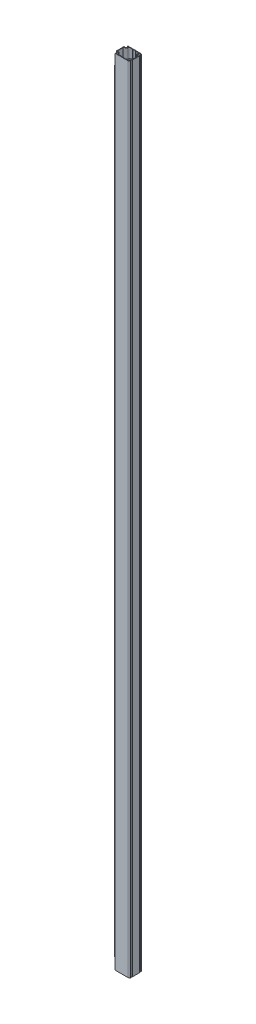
ISO-10303-21;
HEADER;
FILE_DESCRIPTION(('STEP AP214'),'2;1');
FILE_NAME('part.step','',(''),(''),'','','');
FILE_SCHEMA(('AUTOMOTIVE_DESIGN { 1 0 10303 214 1 1 1 1 }'));
ENDSEC;
DATA;
#1=APPLICATION_CONTEXT('core data for automotive mechanical design processes');
#2=APPLICATION_PROTOCOL_DEFINITION('international standard','automotive_design',2000,#1);
#3=PRODUCT_CONTEXT('',#1,'mechanical');
#4=PRODUCT('Part','Part','',(#3));
#5=PRODUCT_RELATED_PRODUCT_CATEGORY('part','',(#4));
#6=PRODUCT_DEFINITION_FORMATION('','',#4);
#7=PRODUCT_DEFINITION_CONTEXT('part definition',#1,'design');
#8=PRODUCT_DEFINITION('design','',#6,#7);
#9=PRODUCT_DEFINITION_SHAPE('','',#8);
#10=(LENGTH_UNIT() NAMED_UNIT(*) SI_UNIT(.MILLI.,.METRE.));
#11=(NAMED_UNIT(*) PLANE_ANGLE_UNIT() SI_UNIT($,.RADIAN.));
#12=(NAMED_UNIT(*) SI_UNIT($,.STERADIAN.) SOLID_ANGLE_UNIT());
#13=UNCERTAINTY_MEASURE_WITH_UNIT(LENGTH_MEASURE(1.E-05),#10,'distance_accuracy_value','');
#14=(GEOMETRIC_REPRESENTATION_CONTEXT(3) GLOBAL_UNCERTAINTY_ASSIGNED_CONTEXT((#13)) GLOBAL_UNIT_ASSIGNED_CONTEXT((#10,
#11,#12)) REPRESENTATION_CONTEXT('',''));
#15=CARTESIAN_POINT('',(0.,0.,0.));
#16=DIRECTION('',(0.,0.,1.));
#17=DIRECTION('',(1.,0.,0.));
#18=AXIS2_PLACEMENT_3D('',#15,#16,#17);
#19=CARTESIAN_POINT('',(-40.4999999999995,5000.,-30.4999999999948));
#20=DIRECTION('',(0.,-1.,0.));
#21=DIRECTION('',(0.,0.,-1.));
#22=AXIS2_PLACEMENT_3D('',#19,#20,#21);
#23=CYLINDRICAL_SURFACE('',#22,9.5);
#24=CARTESIAN_POINT('',(-40.4999999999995,70.0000000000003,-30.4999999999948));
#25=DIRECTION('',(0.,-1.,0.));
#26=DIRECTION('',(0.,0.,-1.));
#27=AXIS2_PLACEMENT_3D('',#24,#25,#26);
#28=CIRCLE('',#27,9.5);
#29=CARTESIAN_POINT('',(-49.7424570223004,70.0000000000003,-32.6970407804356));
#30=VERTEX_POINT('',#29);
#31=CARTESIAN_POINT('',(-40.4999999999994,70.,-39.9999999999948));
#32=VERTEX_POINT('',#31);
#33=EDGE_CURVE('E509',#30,#32,#28,.T.);
#34=ORIENTED_EDGE('',*,*,#33,.F.);
#35=DIRECTION('',(0.,-1.,0.));
#36=VECTOR('',#35,1.);
#37=CARTESIAN_POINT('',(-49.7424570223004,5000.,-32.6970407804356));
#38=LINE('',#37,#36);
#39=CARTESIAN_POINT('',(-49.7424570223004,4930.,-32.6970407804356));
#40=VERTEX_POINT('',#39);
#41=EDGE_CURVE('E479',#40,#30,#38,.T.);
#42=ORIENTED_EDGE('',*,*,#41,.F.);
#43=CARTESIAN_POINT('',(-40.4999999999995,4930.,-30.4999999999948));
#44=DIRECTION('',(0.,1.,0.));
#45=DIRECTION('',(0.,0.,1.));
#46=AXIS2_PLACEMENT_3D('',#43,#44,#45);
#47=CIRCLE('',#46,9.5);
#48=CARTESIAN_POINT('',(-40.4999999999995,4930.,-39.9999999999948));
#49=VERTEX_POINT('',#48);
#50=EDGE_CURVE('E541',#49,#40,#47,.T.);
#51=ORIENTED_EDGE('',*,*,#50,.F.);
#52=DIRECTION('',(0.,-1.,0.));
#53=VECTOR('',#52,1.);
#54=CARTESIAN_POINT('',(-40.4999999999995,5000.,-39.9999999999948));
#55=LINE('',#54,#53);
#56=EDGE_CURVE('E482',#49,#32,#55,.T.);
#57=ORIENTED_EDGE('',*,*,#56,.T.);
#58=EDGE_LOOP('',(#34,#42,#51,#57));
#59=FACE_BOUND('',#58,.T.);
#60=ADVANCED_FACE('F53',(#59),#23,.T.);
#61=CARTESIAN_POINT('',(-48.2831217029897,5000.,-32.3501396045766));
#62=DIRECTION('',(0.,-1.,0.));
#63=DIRECTION('',(0.,0.,-1.));
#64=AXIS2_PLACEMENT_3D('',#61,#62,#63);
#65=CYLINDRICAL_SURFACE('',#64,1.50000000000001);
#66=CARTESIAN_POINT('',(-48.2831217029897,70.0000000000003,-32.3501396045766));
#67=DIRECTION('',(0.,-1.,0.));
#68=DIRECTION('',(0.,0.,-1.));
#69=AXIS2_PLACEMENT_3D('',#66,#67,#68);
#70=CIRCLE('',#69,1.50000000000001);
#71=CARTESIAN_POINT('',(-46.8237863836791,70.0000000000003,-32.0032384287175));
#72=VERTEX_POINT('',#71);
#73=EDGE_CURVE('E447',#72,#30,#70,.T.);
#74=ORIENTED_EDGE('',*,*,#73,.F.);
#75=DIRECTION('',(0.,-1.,0.));
#76=VECTOR('',#75,1.);
#77=CARTESIAN_POINT('',(-46.8237863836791,5000.,-32.0032384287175));
#78=LINE('',#77,#76);
#79=CARTESIAN_POINT('',(-46.8237863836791,4930.,-32.0032384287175));
#80=VERTEX_POINT('',#79);
#81=EDGE_CURVE('E476',#80,#72,#78,.T.);
#82=ORIENTED_EDGE('',*,*,#81,.F.);
#83=CARTESIAN_POINT('',(-48.2831217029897,4930.,-32.3501396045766));
#84=DIRECTION('',(0.,1.,0.));
#85=DIRECTION('',(0.,0.,1.));
#86=AXIS2_PLACEMENT_3D('',#83,#84,#85);
#87=CIRCLE('',#86,1.50000000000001);
#88=EDGE_CURVE('E76',#40,#80,#87,.T.);
#89=ORIENTED_EDGE('',*,*,#88,.F.);
#90=ORIENTED_EDGE('',*,*,#41,.T.);
#91=EDGE_LOOP('',(#74,#82,#89,#90));
#92=FACE_BOUND('',#91,.T.);
#93=ADVANCED_FACE('F507',(#92),#65,.T.);
#94=CARTESIAN_POINT('',(-48.2831217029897,5000.,32.3501396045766));
#95=DIRECTION('',(0.,-1.,0.));
#96=DIRECTION('',(0.,0.,-1.));
#97=AXIS2_PLACEMENT_3D('',#94,#95,#96);
#98=CYLINDRICAL_SURFACE('',#97,1.50000000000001);
#99=CARTESIAN_POINT('',(-48.2831217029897,70.0000000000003,32.3501396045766));
#100=DIRECTION('',(0.,-1.,0.));
#101=DIRECTION('',(0.,0.,-1.));
#102=AXIS2_PLACEMENT_3D('',#99,#100,#101);
#103=CIRCLE('',#102,1.50000000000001);
#104=CARTESIAN_POINT('',(-49.7424570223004,70.0000000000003,32.6970407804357));
#105=VERTEX_POINT('',#104);
#106=CARTESIAN_POINT('',(-46.823786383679,70.0000000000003,32.0032384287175));
#107=VERTEX_POINT('',#106);
#108=EDGE_CURVE('E448',#105,#107,#103,.T.);
#109=ORIENTED_EDGE('',*,*,#108,.F.);
#110=DIRECTION('',(0.,-1.,0.));
#111=VECTOR('',#110,1.);
#112=CARTESIAN_POINT('',(-49.7424570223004,5000.,32.6970407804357));
#113=LINE('',#112,#111);
#114=CARTESIAN_POINT('',(-49.7424570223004,4930.,32.6970407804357));
#115=VERTEX_POINT('',#114);
#116=EDGE_CURVE('E446',#115,#105,#113,.T.);
#117=ORIENTED_EDGE('',*,*,#116,.F.);
#118=CARTESIAN_POINT('',(-48.2831217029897,4930.,32.3501396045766));
#119=DIRECTION('',(0.,1.,0.));
#120=DIRECTION('',(0.,0.,1.));
#121=AXIS2_PLACEMENT_3D('',#118,#119,#120);
#122=CIRCLE('',#121,1.50000000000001);
#123=CARTESIAN_POINT('',(-46.823786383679,4930.,32.0032384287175));
#124=VERTEX_POINT('',#123);
#125=EDGE_CURVE('E525',#124,#115,#122,.T.);
#126=ORIENTED_EDGE('',*,*,#125,.F.);
#127=DIRECTION('',(0.,-1.,0.));
#128=VECTOR('',#127,1.);
#129=CARTESIAN_POINT('',(-46.823786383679,5000.,32.0032384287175));
#130=LINE('',#129,#128);
#131=EDGE_CURVE('E461',#124,#107,#130,.T.);
#132=ORIENTED_EDGE('',*,*,#131,.T.);
#133=EDGE_LOOP('',(#109,#117,#126,#132));
#134=FACE_BOUND('',#133,.T.);
#135=ADVANCED_FACE('F955',(#134),#98,.T.);
#136=CARTESIAN_POINT('',(-40.4999999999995,5000.,30.4999999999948));
#137=DIRECTION('',(0.,-1.,0.));
#138=DIRECTION('',(0.,0.,-1.));
#139=AXIS2_PLACEMENT_3D('',#136,#137,#138);
#140=CYLINDRICAL_SURFACE('',#139,9.5);
#141=CARTESIAN_POINT('',(-40.4999999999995,70.0000000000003,30.4999999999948));
#142=DIRECTION('',(0.,-1.,0.));
#143=DIRECTION('',(0.,0.,-1.));
#144=AXIS2_PLACEMENT_3D('',#141,#142,#143);
#145=CIRCLE('',#144,9.5);
#146=CARTESIAN_POINT('',(-40.4999999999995,70.,39.9999999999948));
#147=VERTEX_POINT('',#146);
#148=EDGE_CURVE('E421',#147,#105,#145,.T.);
#149=ORIENTED_EDGE('',*,*,#148,.F.);
#150=DIRECTION('',(0.,-1.,0.));
#151=VECTOR('',#150,1.);
#152=CARTESIAN_POINT('',(-40.4999999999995,5000.,39.9999999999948));
#153=LINE('',#152,#151);
#154=CARTESIAN_POINT('',(-40.4999999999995,4930.,39.9999999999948));
#155=VERTEX_POINT('',#154);
#156=EDGE_CURVE('E443',#155,#147,#153,.T.);
#157=ORIENTED_EDGE('',*,*,#156,.F.);
#158=CARTESIAN_POINT('',(-40.4999999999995,4930.,30.4999999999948));
#159=DIRECTION('',(0.,1.,0.));
#160=DIRECTION('',(0.,0.,1.));
#161=AXIS2_PLACEMENT_3D('',#158,#159,#160);
#162=CIRCLE('',#161,9.5);
#163=EDGE_CURVE('E492',#115,#155,#162,.T.);
#164=ORIENTED_EDGE('',*,*,#163,.F.);
#165=ORIENTED_EDGE('',*,*,#116,.T.);
#166=EDGE_LOOP('',(#149,#157,#164,#165));
#167=FACE_BOUND('',#166,.T.);
#168=ADVANCED_FACE('F441',(#167),#140,.T.);
#169=CARTESIAN_POINT('',(48.2831217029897,5000.,-32.3501396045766));
#170=DIRECTION('',(0.,1.,0.));
#171=DIRECTION('',(0.,0.,1.));
#172=AXIS2_PLACEMENT_3D('',#169,#170,#171);
#173=PLANE('',#172);
#174=DIRECTION('',(0.,0.,-1.));
#175=VECTOR('',#174,1.);
#176=CARTESIAN_POINT('',(-40.4999999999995,5000.,-30.4999999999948));
#177=LINE('',#176,#175);
#178=CARTESIAN_POINT('',(-40.4999999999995,5000.,-36.9999999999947));
#179=VERTEX_POINT('',#178);
#180=CARTESIAN_POINT('',(-40.4999999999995,5000.,-39.9999999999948));
#181=VERTEX_POINT('',#180);
#182=EDGE_CURVE('E522',#179,#181,#177,.T.);
#183=ORIENTED_EDGE('',*,*,#182,.F.);
#184=CARTESIAN_POINT('',(-40.4999999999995,5000.,-30.4999999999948));
#185=DIRECTION('',(0.,-1.,0.));
#186=DIRECTION('',(0.,0.,-1.));
#187=AXIS2_PLACEMENT_3D('',#184,#185,#186);
#188=CIRCLE('',#187,6.49999999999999);
#189=CARTESIAN_POINT('',(-43.9047619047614,5000.,-24.9630697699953));
#190=VERTEX_POINT('',#189);
#191=EDGE_CURVE('E780',#179,#190,#188,.T.);
#192=ORIENTED_EDGE('',*,*,#191,.T.);
#193=CARTESIAN_POINT('',(-45.9999999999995,5000.,-21.5557280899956));
#194=DIRECTION('',(0.,1.,0.));
#195=DIRECTION('',(0.,0.,-1.));
#196=AXIS2_PLACEMENT_3D('',#193,#194,#195);
#197=CIRCLE('',#196,4.);
#198=CARTESIAN_POINT('',(-49.9999999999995,5000.,-21.5557280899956));
#199=VERTEX_POINT('',#198);
#200=EDGE_CURVE('E782',#190,#199,#197,.T.);
#201=ORIENTED_EDGE('',*,*,#200,.T.);
#202=DIRECTION('',(0.,0.,1.));
#203=VECTOR('',#202,1.);
#204=CARTESIAN_POINT('',(-49.9999999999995,5000.,-21.5557280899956));
#205=LINE('',#204,#203);
#206=CARTESIAN_POINT('',(-49.9999999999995,5000.,21.5557280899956));
#207=VERTEX_POINT('',#206);
#208=EDGE_CURVE('E784',#199,#207,#205,.T.);
#209=ORIENTED_EDGE('',*,*,#208,.T.);
#210=CARTESIAN_POINT('',(-45.9999999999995,5000.,21.5557280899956));
#211=DIRECTION('',(0.,1.,0.));
#212=DIRECTION('',(0.,0.,1.));
#213=AXIS2_PLACEMENT_3D('',#210,#211,#212);
#214=CIRCLE('',#213,4.);
#215=CARTESIAN_POINT('',(-43.9047619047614,5000.,24.9630697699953));
#216=VERTEX_POINT('',#215);
#217=EDGE_CURVE('E786',#207,#216,#214,.T.);
#218=ORIENTED_EDGE('',*,*,#217,.T.);
#219=CARTESIAN_POINT('',(-40.4999999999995,5000.,30.4999999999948));
#220=DIRECTION('',(0.,-1.,0.));
#221=DIRECTION('',(0.,0.,1.));
#222=AXIS2_PLACEMENT_3D('',#219,#220,#221);
#223=CIRCLE('',#222,6.5);
#224=CARTESIAN_POINT('',(-40.4999999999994,5000.,36.9999999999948));
#225=VERTEX_POINT('',#224);
#226=EDGE_CURVE('E788',#216,#225,#223,.T.);
#227=ORIENTED_EDGE('',*,*,#226,.T.);
#228=DIRECTION('',(0.,0.,-1.));
#229=VECTOR('',#228,1.);
#230=CARTESIAN_POINT('',(-40.4999999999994,5000.,45.5169252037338));
#231=LINE('',#230,#229);
#232=CARTESIAN_POINT('',(-40.4999999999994,5000.,39.9999999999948));
#233=VERTEX_POINT('',#232);
#234=EDGE_CURVE('E535',#233,#225,#231,.T.);
#235=ORIENTED_EDGE('',*,*,#234,.F.);
#236=DIRECTION('',(1.,0.,0.));
#237=VECTOR('',#236,1.);
#238=CARTESIAN_POINT('',(40.4999999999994,5000.,39.9999999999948));
#239=LINE('',#238,#237);
#240=CARTESIAN_POINT('',(40.4999999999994,5000.,39.9999999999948));
#241=VERTEX_POINT('',#240);
#242=EDGE_CURVE('E791',#233,#241,#239,.T.);
#243=ORIENTED_EDGE('',*,*,#242,.T.);
#244=CARTESIAN_POINT('',(40.4999999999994,5000.,30.4999999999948));
#245=DIRECTION('',(0.,1.,0.));
#246=DIRECTION('',(0.,0.,-1.));
#247=AXIS2_PLACEMENT_3D('',#244,#245,#246);
#248=CIRCLE('',#247,9.5);
#249=CARTESIAN_POINT('',(49.7424570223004,5000.,32.6970407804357));
#250=VERTEX_POINT('',#249);
#251=EDGE_CURVE('E793',#241,#250,#248,.T.);
#252=ORIENTED_EDGE('',*,*,#251,.T.);
#253=CARTESIAN_POINT('',(48.2831217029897,5000.,32.3501396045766));
#254=DIRECTION('',(0.,1.,0.));
#255=DIRECTION('',(0.,0.,-1.));
#256=AXIS2_PLACEMENT_3D('',#253,#254,#255);
#257=CIRCLE('',#256,1.50000000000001);
#258=CARTESIAN_POINT('',(46.823786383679,5000.,32.0032384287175));
#259=VERTEX_POINT('',#258);
#260=EDGE_CURVE('E795',#250,#259,#257,.T.);
#261=ORIENTED_EDGE('',*,*,#260,.T.);
#262=CARTESIAN_POINT('',(40.4999999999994,5000.,30.4999999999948));
#263=DIRECTION('',(0.,-1.,0.));
#264=DIRECTION('',(0.,0.,-1.));
#265=AXIS2_PLACEMENT_3D('',#262,#263,#264);
#266=CIRCLE('',#265,6.5);
#267=CARTESIAN_POINT('',(43.9047619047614,5000.,24.9630697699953));
#268=VERTEX_POINT('',#267);
#269=EDGE_CURVE('E797',#259,#268,#266,.T.);
#270=ORIENTED_EDGE('',*,*,#269,.T.);
#271=CARTESIAN_POINT('',(45.9999999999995,5000.,21.5557280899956));
#272=DIRECTION('',(0.,1.,0.));
#273=DIRECTION('',(0.,0.,-1.));
#274=AXIS2_PLACEMENT_3D('',#271,#272,#273);
#275=CIRCLE('',#274,4.);
#276=CARTESIAN_POINT('',(49.9999999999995,5000.,21.5557280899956));
#277=VERTEX_POINT('',#276);
#278=EDGE_CURVE('E799',#268,#277,#275,.T.);
#279=ORIENTED_EDGE('',*,*,#278,.T.);
#280=DIRECTION('',(0.,0.,-1.));
#281=VECTOR('',#280,1.);
#282=CARTESIAN_POINT('',(49.9999999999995,5000.,-21.5557280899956));
#283=LINE('',#282,#281);
#284=CARTESIAN_POINT('',(49.9999999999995,5000.,-21.5557280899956));
#285=VERTEX_POINT('',#284);
#286=EDGE_CURVE('E801',#277,#285,#283,.T.);
#287=ORIENTED_EDGE('',*,*,#286,.T.);
#288=CARTESIAN_POINT('',(45.9999999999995,5000.,-21.5557280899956));
#289=DIRECTION('',(0.,1.,0.));
#290=DIRECTION('',(0.,0.,1.));
#291=AXIS2_PLACEMENT_3D('',#288,#289,#290);
#292=CIRCLE('',#291,4.);
#293=CARTESIAN_POINT('',(43.9047619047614,5000.,-24.9630697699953));
#294=VERTEX_POINT('',#293);
#295=EDGE_CURVE('E803',#285,#294,#292,.T.);
#296=ORIENTED_EDGE('',*,*,#295,.T.);
#297=CARTESIAN_POINT('',(40.4999999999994,5000.,-30.4999999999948));
#298=DIRECTION('',(0.,-1.,0.));
#299=DIRECTION('',(0.,0.,1.));
#300=AXIS2_PLACEMENT_3D('',#297,#298,#299);
#301=CIRCLE('',#300,6.5);
#302=CARTESIAN_POINT('',(46.823786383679,5000.,-32.0032384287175));
#303=VERTEX_POINT('',#302);
#304=EDGE_CURVE('E805',#294,#303,#301,.T.);
#305=ORIENTED_EDGE('',*,*,#304,.T.);
#306=CARTESIAN_POINT('',(48.2831217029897,5000.,-32.3501396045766));
#307=DIRECTION('',(0.,1.,0.));
#308=DIRECTION('',(0.,0.,1.));
#309=AXIS2_PLACEMENT_3D('',#306,#307,#308);
#310=CIRCLE('',#309,1.50000000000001);
#311=CARTESIAN_POINT('',(49.7424570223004,5000.,-32.6970407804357));
#312=VERTEX_POINT('',#311);
#313=EDGE_CURVE('E771',#303,#312,#310,.T.);
#314=ORIENTED_EDGE('',*,*,#313,.T.);
#315=CARTESIAN_POINT('',(40.4999999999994,5000.,-30.4999999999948));
#316=DIRECTION('',(0.,1.,0.));
#317=DIRECTION('',(0.,0.,1.));
#318=AXIS2_PLACEMENT_3D('',#315,#316,#317);
#319=CIRCLE('',#318,9.5);
#320=CARTESIAN_POINT('',(40.4999999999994,5000.,-39.9999999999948));
#321=VERTEX_POINT('',#320);
#322=EDGE_CURVE('E774',#312,#321,#319,.T.);
#323=ORIENTED_EDGE('',*,*,#322,.T.);
#324=DIRECTION('',(-1.,0.,0.));
#325=VECTOR('',#324,1.);
#326=CARTESIAN_POINT('',(40.4999999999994,5000.,-39.9999999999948));
#327=LINE('',#326,#325);
#328=EDGE_CURVE('E777',#321,#181,#327,.T.);
#329=ORIENTED_EDGE('',*,*,#328,.T.);
#330=EDGE_LOOP('',(#183,#192,#201,#209,#218,#227,#235,#243,#252,#261,#270,#279,#287,#296,#305,
#314,#323,#329));
#331=FACE_BOUND('',#330,.T.);
#332=DIRECTION('',(-1.,0.,1.07552855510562E-13));
#333=VECTOR('',#332,1.);
#334=CARTESIAN_POINT('',(-12.5,5000.,-36.9999999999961));
#335=LINE('',#334,#333);
#336=CARTESIAN_POINT('',(-12.5,5000.,-36.9999999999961));
#337=VERTEX_POINT('',#336);
#338=CARTESIAN_POINT('',(-24.4999999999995,5000.,-36.9999999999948));
#339=VERTEX_POINT('',#338);
#340=EDGE_CURVE('E546',#337,#339,#335,.T.);
#341=ORIENTED_EDGE('',*,*,#340,.F.);
#342=DIRECTION('',(-0.707106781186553,0.,-0.707106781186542));
#343=VECTOR('',#342,1.);
#344=CARTESIAN_POINT('',(-11.,5000.,-35.4999999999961));
#345=LINE('',#344,#343);
#346=CARTESIAN_POINT('',(-11.,5000.,-35.4999999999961));
#347=VERTEX_POINT('',#346);
#348=EDGE_CURVE('E544',#347,#337,#345,.T.);
#349=ORIENTED_EDGE('',*,*,#348,.F.);
#350=DIRECTION('',(-1.,0.,0.));
#351=VECTOR('',#350,1.);
#352=CARTESIAN_POINT('',(-11.,5000.,-35.4999999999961));
#353=LINE('',#352,#351);
#354=CARTESIAN_POINT('',(-8.,5000.,-35.4999999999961));
#355=VERTEX_POINT('',#354);
#356=EDGE_CURVE('E608',#355,#347,#353,.T.);
#357=ORIENTED_EDGE('',*,*,#356,.F.);
#358=DIRECTION('',(-0.707106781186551,0.,0.707106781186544));
#359=VECTOR('',#358,1.);
#360=CARTESIAN_POINT('',(-8.,5000.,-35.4999999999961));
#361=LINE('',#360,#359);
#362=CARTESIAN_POINT('',(-6.50000000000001,5000.,-36.9999999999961));
#363=VERTEX_POINT('',#362);
#364=EDGE_CURVE('E605',#363,#355,#361,.T.);
#365=ORIENTED_EDGE('',*,*,#364,.F.);
#366=DIRECTION('',(-1.,0.,0.));
#367=VECTOR('',#366,1.);
#368=CARTESIAN_POINT('',(6.50000000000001,5000.,-36.9999999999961));
#369=LINE('',#368,#367);
#370=CARTESIAN_POINT('',(6.50000000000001,5000.,-36.9999999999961));
#371=VERTEX_POINT('',#370);
#372=EDGE_CURVE('E603',#371,#363,#369,.T.);
#373=ORIENTED_EDGE('',*,*,#372,.F.);
#374=DIRECTION('',(-0.707106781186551,0.,-0.707106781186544));
#375=VECTOR('',#374,1.);
#376=CARTESIAN_POINT('',(8.,5000.,-35.4999999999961));
#377=LINE('',#376,#375);
#378=CARTESIAN_POINT('',(8.,5000.,-35.4999999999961));
#379=VERTEX_POINT('',#378);
#380=EDGE_CURVE('E601',#379,#371,#377,.T.);
#381=ORIENTED_EDGE('',*,*,#380,.F.);
#382=DIRECTION('',(-1.,0.,0.));
#383=VECTOR('',#382,1.);
#384=CARTESIAN_POINT('',(11.,5000.,-35.4999999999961));
#385=LINE('',#384,#383);
#386=CARTESIAN_POINT('',(11.,5000.,-35.4999999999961));
#387=VERTEX_POINT('',#386);
#388=EDGE_CURVE('E599',#387,#379,#385,.T.);
#389=ORIENTED_EDGE('',*,*,#388,.F.);
#390=DIRECTION('',(-0.707106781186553,0.,0.707106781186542));
#391=VECTOR('',#390,1.);
#392=CARTESIAN_POINT('',(11.,5000.,-35.4999999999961));
#393=LINE('',#392,#391);
#394=CARTESIAN_POINT('',(12.5,5000.,-36.9999999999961));
#395=VERTEX_POINT('',#394);
#396=EDGE_CURVE('E597',#395,#387,#393,.T.);
#397=ORIENTED_EDGE('',*,*,#396,.F.);
#398=DIRECTION('',(-1.,0.,0.));
#399=VECTOR('',#398,1.);
#400=CARTESIAN_POINT('',(24.4999999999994,5000.,-36.9999999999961));
#401=LINE('',#400,#399);
#402=CARTESIAN_POINT('',(24.4999999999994,5000.,-36.9999999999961));
#403=VERTEX_POINT('',#402);
#404=EDGE_CURVE('E595',#403,#395,#401,.T.);
#405=ORIENTED_EDGE('',*,*,#404,.F.);
#406=CARTESIAN_POINT('',(24.4999999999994,5000.,-30.4999999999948));
#407=DIRECTION('',(0.,1.,0.));
#408=DIRECTION('',(0.,0.,1.));
#409=AXIS2_PLACEMENT_3D('',#406,#407,#408);
#410=CIRCLE('',#409,6.50000000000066);
#411=CARTESIAN_POINT('',(31.0000000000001,5000.,-30.4999999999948));
#412=VERTEX_POINT('',#411);
#413=EDGE_CURVE('E593',#412,#403,#410,.T.);
#414=ORIENTED_EDGE('',*,*,#413,.F.);
#415=CARTESIAN_POINT('',(40.4999999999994,5000.,-30.4999999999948));
#416=DIRECTION('',(0.,-1.,0.));
#417=DIRECTION('',(0.,0.,1.));
#418=AXIS2_PLACEMENT_3D('',#415,#416,#417);
#419=CIRCLE('',#418,9.5);
#420=CARTESIAN_POINT('',(40.4999999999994,5000.,-20.9999999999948));
#421=VERTEX_POINT('',#420);
#422=EDGE_CURVE('E591',#421,#412,#419,.T.);
#423=ORIENTED_EDGE('',*,*,#422,.F.);
#424=CARTESIAN_POINT('',(40.4999999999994,5000.,-14.4999999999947));
#425=DIRECTION('',(0.,1.,0.));
#426=DIRECTION('',(0.,0.,1.));
#427=AXIS2_PLACEMENT_3D('',#424,#425,#426);
#428=CIRCLE('',#427,6.50000000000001);
#429=CARTESIAN_POINT('',(46.9999999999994,5000.,-14.4999999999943));
#430=VERTEX_POINT('',#429);
#431=EDGE_CURVE('E589',#430,#421,#428,.T.);
#432=ORIENTED_EDGE('',*,*,#431,.F.);
#433=DIRECTION('',(0.,0.,-1.));
#434=VECTOR('',#433,1.);
#435=CARTESIAN_POINT('',(46.9999999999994,5000.,-14.4999999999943));
#436=LINE('',#435,#434);
#437=CARTESIAN_POINT('',(46.9999999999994,5000.,14.4999999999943));
#438=VERTEX_POINT('',#437);
#439=EDGE_CURVE('E587',#438,#430,#436,.T.);
#440=ORIENTED_EDGE('',*,*,#439,.F.);
#441=CARTESIAN_POINT('',(40.4999999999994,5000.,14.4999999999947));
#442=DIRECTION('',(0.,1.,0.));
#443=DIRECTION('',(0.,0.,-1.));
#444=AXIS2_PLACEMENT_3D('',#441,#442,#443);
#445=CIRCLE('',#444,6.50000000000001);
#446=CARTESIAN_POINT('',(40.4999999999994,5000.,20.9999999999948));
#447=VERTEX_POINT('',#446);
#448=EDGE_CURVE('E585',#447,#438,#445,.T.);
#449=ORIENTED_EDGE('',*,*,#448,.F.);
#450=CARTESIAN_POINT('',(40.4999999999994,5000.,30.4999999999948));
#451=DIRECTION('',(0.,-1.,0.));
#452=DIRECTION('',(0.,0.,-1.));
#453=AXIS2_PLACEMENT_3D('',#450,#451,#452);
#454=CIRCLE('',#453,9.5);
#455=CARTESIAN_POINT('',(30.9999999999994,5000.,30.4999999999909));
#456=VERTEX_POINT('',#455);
#457=EDGE_CURVE('E583',#456,#447,#454,.T.);
#458=ORIENTED_EDGE('',*,*,#457,.F.);
#459=CARTESIAN_POINT('',(24.4999999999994,5000.,30.4999999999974));
#460=DIRECTION('',(0.,1.,0.));
#461=DIRECTION('',(0.,0.,-1.));
#462=AXIS2_PLACEMENT_3D('',#459,#460,#461);
#463=CIRCLE('',#462,6.50000000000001);
#464=CARTESIAN_POINT('',(24.5,5000.,36.9999999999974));
#465=VERTEX_POINT('',#464);
#466=EDGE_CURVE('E581',#465,#456,#463,.T.);
#467=ORIENTED_EDGE('',*,*,#466,.F.);
#468=DIRECTION('',(1.,0.,1.0870933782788E-13));
#469=VECTOR('',#468,1.);
#470=CARTESIAN_POINT('',(24.5,5000.,36.9999999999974));
#471=LINE('',#470,#469);
#472=CARTESIAN_POINT('',(12.5,5000.,36.9999999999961));
#473=VERTEX_POINT('',#472);
#474=EDGE_CURVE('E579',#473,#465,#471,.T.);
#475=ORIENTED_EDGE('',*,*,#474,.F.);
#476=DIRECTION('',(0.707106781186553,0.,0.707106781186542));
#477=VECTOR('',#476,1.);
#478=CARTESIAN_POINT('',(11.,5000.,35.4999999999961));
#479=LINE('',#478,#477);
#480=CARTESIAN_POINT('',(11.,5000.,35.4999999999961));
#481=VERTEX_POINT('',#480);
#482=EDGE_CURVE('E577',#481,#473,#479,.T.);
#483=ORIENTED_EDGE('',*,*,#482,.F.);
#484=DIRECTION('',(1.,0.,0.));
#485=VECTOR('',#484,1.);
#486=CARTESIAN_POINT('',(11.,5000.,35.4999999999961));
#487=LINE('',#486,#485);
#488=CARTESIAN_POINT('',(8.,5000.,35.4999999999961));
#489=VERTEX_POINT('',#488);
#490=EDGE_CURVE('E575',#489,#481,#487,.T.);
#491=ORIENTED_EDGE('',*,*,#490,.F.);
#492=DIRECTION('',(0.707106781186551,0.,-0.707106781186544));
#493=VECTOR('',#492,1.);
#494=CARTESIAN_POINT('',(8.,5000.,35.4999999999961));
#495=LINE('',#494,#493);
#496=CARTESIAN_POINT('',(6.50000000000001,5000.,36.9999999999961));
#497=VERTEX_POINT('',#496);
#498=EDGE_CURVE('E573',#497,#489,#495,.T.);
#499=ORIENTED_EDGE('',*,*,#498,.F.);
#500=DIRECTION('',(1.,0.,0.));
#501=VECTOR('',#500,1.);
#502=CARTESIAN_POINT('',(6.50000000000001,5000.,36.9999999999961));
#503=LINE('',#502,#501);
#504=CARTESIAN_POINT('',(-6.50000000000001,5000.,36.9999999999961));
#505=VERTEX_POINT('',#504);
#506=EDGE_CURVE('E571',#505,#497,#503,.T.);
#507=ORIENTED_EDGE('',*,*,#506,.F.);
#508=DIRECTION('',(0.707106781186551,0.,0.707106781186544));
#509=VECTOR('',#508,1.);
#510=CARTESIAN_POINT('',(-8.,5000.,35.4999999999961));
#511=LINE('',#510,#509);
#512=CARTESIAN_POINT('',(-8.,5000.,35.4999999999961));
#513=VERTEX_POINT('',#512);
#514=EDGE_CURVE('E569',#513,#505,#511,.T.);
#515=ORIENTED_EDGE('',*,*,#514,.F.);
#516=DIRECTION('',(1.,0.,0.));
#517=VECTOR('',#516,1.);
#518=CARTESIAN_POINT('',(-11.,5000.,35.4999999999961));
#519=LINE('',#518,#517);
#520=CARTESIAN_POINT('',(-11.,5000.,35.4999999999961));
#521=VERTEX_POINT('',#520);
#522=EDGE_CURVE('E567',#521,#513,#519,.T.);
#523=ORIENTED_EDGE('',*,*,#522,.F.);
#524=DIRECTION('',(0.707106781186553,0.,-0.707106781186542));
#525=VECTOR('',#524,1.);
#526=CARTESIAN_POINT('',(-11.,5000.,35.4999999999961));
#527=LINE('',#526,#525);
#528=CARTESIAN_POINT('',(-12.5,5000.,36.9999999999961));
#529=VERTEX_POINT('',#528);
#530=EDGE_CURVE('E565',#529,#521,#527,.T.);
#531=ORIENTED_EDGE('',*,*,#530,.F.);
#532=DIRECTION('',(1.,0.,-1.0870933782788E-13));
#533=VECTOR('',#532,1.);
#534=CARTESIAN_POINT('',(-12.5,5000.,36.9999999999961));
#535=LINE('',#534,#533);
#536=CARTESIAN_POINT('',(-24.5,5000.,36.9999999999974));
#537=VERTEX_POINT('',#536);
#538=EDGE_CURVE('E563',#537,#529,#535,.T.);
#539=ORIENTED_EDGE('',*,*,#538,.F.);
#540=CARTESIAN_POINT('',(-24.4999999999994,5000.,30.4999999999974));
#541=DIRECTION('',(0.,1.,0.));
#542=DIRECTION('',(0.,0.,1.));
#543=AXIS2_PLACEMENT_3D('',#540,#541,#542);
#544=CIRCLE('',#543,6.50000000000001);
#545=CARTESIAN_POINT('',(-30.9999999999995,5000.,30.4999999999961));
#546=VERTEX_POINT('',#545);
#547=EDGE_CURVE('E561',#546,#537,#544,.T.);
#548=ORIENTED_EDGE('',*,*,#547,.F.);
#549=CARTESIAN_POINT('',(-40.4999999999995,5000.,30.4999999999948));
#550=DIRECTION('',(0.,-1.,0.));
#551=DIRECTION('',(0.,0.,1.));
#552=AXIS2_PLACEMENT_3D('',#549,#550,#551);
#553=CIRCLE('',#552,9.5);
#554=CARTESIAN_POINT('',(-40.4999999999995,5000.,20.9999999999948));
#555=VERTEX_POINT('',#554);
#556=EDGE_CURVE('E559',#555,#546,#553,.T.);
#557=ORIENTED_EDGE('',*,*,#556,.F.);
#558=CARTESIAN_POINT('',(-40.4999999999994,5000.,14.4999999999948));
#559=DIRECTION('',(0.,1.,0.));
#560=DIRECTION('',(0.,0.,1.));
#561=AXIS2_PLACEMENT_3D('',#558,#559,#560);
#562=CIRCLE('',#561,6.50000000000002);
#563=CARTESIAN_POINT('',(-46.9999999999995,5000.,14.4999999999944));
#564=VERTEX_POINT('',#563);
#565=EDGE_CURVE('E557',#564,#555,#562,.T.);
#566=ORIENTED_EDGE('',*,*,#565,.F.);
#567=DIRECTION('',(0.,0.,1.));
#568=VECTOR('',#567,1.);
#569=CARTESIAN_POINT('',(-46.9999999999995,5000.,-14.4999999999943));
#570=LINE('',#569,#568);
#571=CARTESIAN_POINT('',(-46.9999999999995,5000.,-14.4999999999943));
#572=VERTEX_POINT('',#571);
#573=EDGE_CURVE('E555',#572,#564,#570,.T.);
#574=ORIENTED_EDGE('',*,*,#573,.F.);
#575=CARTESIAN_POINT('',(-40.4999999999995,5000.,-14.4999999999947));
#576=DIRECTION('',(0.,1.,0.));
#577=DIRECTION('',(0.,0.,-1.));
#578=AXIS2_PLACEMENT_3D('',#575,#576,#577);
#579=CIRCLE('',#578,6.50000000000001);
#580=CARTESIAN_POINT('',(-40.4999999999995,5000.,-20.9999999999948));
#581=VERTEX_POINT('',#580);
#582=EDGE_CURVE('E553',#581,#572,#579,.T.);
#583=ORIENTED_EDGE('',*,*,#582,.F.);
#584=CARTESIAN_POINT('',(-40.4999999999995,5000.,-30.4999999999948));
#585=DIRECTION('',(0.,-1.,0.));
#586=DIRECTION('',(0.,0.,-1.));
#587=AXIS2_PLACEMENT_3D('',#584,#585,#586);
#588=CIRCLE('',#587,9.50000000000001);
#589=CARTESIAN_POINT('',(-30.9999999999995,5000.,-30.4999999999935));
#590=VERTEX_POINT('',#589);
#591=EDGE_CURVE('E551',#590,#581,#588,.T.);
#592=ORIENTED_EDGE('',*,*,#591,.F.);
#593=CARTESIAN_POINT('',(-24.4999999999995,5000.,-30.4999999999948));
#594=DIRECTION('',(0.,1.,0.));
#595=DIRECTION('',(0.,0.,-1.));
#596=AXIS2_PLACEMENT_3D('',#593,#594,#595);
#597=CIRCLE('',#596,6.50000000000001);
#598=EDGE_CURVE('E549',#339,#590,#597,.T.);
#599=ORIENTED_EDGE('',*,*,#598,.F.);
#600=EDGE_LOOP('',(#341,#349,#357,#365,#373,#381,#389,#397,#405,#414,#423,#432,#440,#449,#458,
#467,#475,#483,#491,#499,#507,#515,#523,#531,#539,#548,#557,#566,#574,#583,#592,#599));
#601=FACE_BOUND('',#600,.T.);
#602=ADVANCED_FACE('F884',(#331,#601),#173,.T.);
#603=CARTESIAN_POINT('',(48.2831217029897,0.,-32.3501396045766));
#604=DIRECTION('',(0.,1.,0.));
#605=DIRECTION('',(0.,0.,1.));
#606=AXIS2_PLACEMENT_3D('',#603,#604,#605);
#607=PLANE('',#606);
#608=CARTESIAN_POINT('',(-40.4999999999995,0.,-30.4999999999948));
#609=DIRECTION('',(0.,-1.,0.));
#610=DIRECTION('',(0.,0.,-1.));
#611=AXIS2_PLACEMENT_3D('',#608,#609,#610);
#612=CIRCLE('',#611,6.49999999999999);
#613=CARTESIAN_POINT('',(-40.4999999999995,0.,-36.9999999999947));
#614=VERTEX_POINT('',#613);
#615=CARTESIAN_POINT('',(-43.9047619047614,0.,-24.9630697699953));
#616=VERTEX_POINT('',#615);
#617=EDGE_CURVE('E815',#614,#616,#612,.T.);
#618=ORIENTED_EDGE('',*,*,#617,.F.);
#619=DIRECTION('',(0.,0.,1.));
#620=VECTOR('',#619,1.);
#621=CARTESIAN_POINT('',(-40.4999999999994,0.,-42.9807240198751));
#622=LINE('',#621,#620);
#623=CARTESIAN_POINT('',(-40.4999999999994,0.,-39.9999999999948));
#624=VERTEX_POINT('',#623);
#625=EDGE_CURVE('E436',#624,#614,#622,.T.);
#626=ORIENTED_EDGE('',*,*,#625,.F.);
#627=DIRECTION('',(-1.,0.,0.));
#628=VECTOR('',#627,1.);
#629=CARTESIAN_POINT('',(40.4999999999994,0.,-39.9999999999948));
#630=LINE('',#629,#628);
#631=CARTESIAN_POINT('',(40.4999999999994,0.,-39.9999999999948));
#632=VERTEX_POINT('',#631);
#633=EDGE_CURVE('E812',#632,#624,#630,.T.);
#634=ORIENTED_EDGE('',*,*,#633,.F.);
#635=CARTESIAN_POINT('',(40.4999999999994,0.,-30.4999999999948));
#636=DIRECTION('',(0.,1.,0.));
#637=DIRECTION('',(0.,0.,1.));
#638=AXIS2_PLACEMENT_3D('',#635,#636,#637);
#639=CIRCLE('',#638,9.5);
#640=CARTESIAN_POINT('',(49.7424570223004,0.,-32.6970407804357));
#641=VERTEX_POINT('',#640);
#642=EDGE_CURVE('E810',#641,#632,#639,.T.);
#643=ORIENTED_EDGE('',*,*,#642,.F.);
#644=CARTESIAN_POINT('',(48.2831217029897,0.,-32.3501396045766));
#645=DIRECTION('',(0.,1.,0.));
#646=DIRECTION('',(0.,0.,1.));
#647=AXIS2_PLACEMENT_3D('',#644,#645,#646);
#648=CIRCLE('',#647,1.50000000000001);
#649=CARTESIAN_POINT('',(46.823786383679,0.,-32.0032384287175));
#650=VERTEX_POINT('',#649);
#651=EDGE_CURVE('E770',#650,#641,#648,.T.);
#652=ORIENTED_EDGE('',*,*,#651,.F.);
#653=CARTESIAN_POINT('',(40.4999999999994,0.,-30.4999999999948));
#654=DIRECTION('',(0.,-1.,0.));
#655=DIRECTION('',(0.,0.,1.));
#656=AXIS2_PLACEMENT_3D('',#653,#654,#655);
#657=CIRCLE('',#656,6.5);
#658=CARTESIAN_POINT('',(43.9047619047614,0.,-24.9630697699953));
#659=VERTEX_POINT('',#658);
#660=EDGE_CURVE('E775',#659,#650,#657,.T.);
#661=ORIENTED_EDGE('',*,*,#660,.F.);
#662=CARTESIAN_POINT('',(45.9999999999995,0.,-21.5557280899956));
#663=DIRECTION('',(0.,1.,0.));
#664=DIRECTION('',(0.,0.,1.));
#665=AXIS2_PLACEMENT_3D('',#662,#663,#664);
#666=CIRCLE('',#665,4.);
#667=CARTESIAN_POINT('',(49.9999999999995,0.,-21.5557280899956));
#668=VERTEX_POINT('',#667);
#669=EDGE_CURVE('E838',#668,#659,#666,.T.);
#670=ORIENTED_EDGE('',*,*,#669,.F.);
#671=DIRECTION('',(0.,0.,-1.));
#672=VECTOR('',#671,1.);
#673=CARTESIAN_POINT('',(49.9999999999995,0.,-21.5557280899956));
#674=LINE('',#673,#672);
#675=CARTESIAN_POINT('',(49.9999999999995,0.,21.5557280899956));
#676=VERTEX_POINT('',#675);
#677=EDGE_CURVE('E836',#676,#668,#674,.T.);
#678=ORIENTED_EDGE('',*,*,#677,.F.);
#679=CARTESIAN_POINT('',(45.9999999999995,0.,21.5557280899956));
#680=DIRECTION('',(0.,1.,0.));
#681=DIRECTION('',(0.,0.,-1.));
#682=AXIS2_PLACEMENT_3D('',#679,#680,#681);
#683=CIRCLE('',#682,4.);
#684=CARTESIAN_POINT('',(43.9047619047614,0.,24.9630697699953));
#685=VERTEX_POINT('',#684);
#686=EDGE_CURVE('E834',#685,#676,#683,.T.);
#687=ORIENTED_EDGE('',*,*,#686,.F.);
#688=CARTESIAN_POINT('',(40.4999999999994,0.,30.4999999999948));
#689=DIRECTION('',(0.,-1.,0.));
#690=DIRECTION('',(0.,0.,-1.));
#691=AXIS2_PLACEMENT_3D('',#688,#689,#690);
#692=CIRCLE('',#691,6.5);
#693=CARTESIAN_POINT('',(46.823786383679,0.,32.0032384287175));
#694=VERTEX_POINT('',#693);
#695=EDGE_CURVE('E832',#694,#685,#692,.T.);
#696=ORIENTED_EDGE('',*,*,#695,.F.);
#697=CARTESIAN_POINT('',(48.2831217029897,0.,32.3501396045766));
#698=DIRECTION('',(0.,1.,0.));
#699=DIRECTION('',(0.,0.,-1.));
#700=AXIS2_PLACEMENT_3D('',#697,#698,#699);
#701=CIRCLE('',#700,1.50000000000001);
#702=CARTESIAN_POINT('',(49.7424570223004,0.,32.6970407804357));
#703=VERTEX_POINT('',#702);
#704=EDGE_CURVE('E830',#703,#694,#701,.T.);
#705=ORIENTED_EDGE('',*,*,#704,.F.);
#706=CARTESIAN_POINT('',(40.4999999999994,0.,30.4999999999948));
#707=DIRECTION('',(0.,1.,0.));
#708=DIRECTION('',(0.,0.,-1.));
#709=AXIS2_PLACEMENT_3D('',#706,#707,#708);
#710=CIRCLE('',#709,9.5);
#711=CARTESIAN_POINT('',(40.4999999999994,0.,39.9999999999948));
#712=VERTEX_POINT('',#711);
#713=EDGE_CURVE('E828',#712,#703,#710,.T.);
#714=ORIENTED_EDGE('',*,*,#713,.F.);
#715=DIRECTION('',(1.,0.,0.));
#716=VECTOR('',#715,1.);
#717=CARTESIAN_POINT('',(40.4999999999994,0.,39.9999999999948));
#718=LINE('',#717,#716);
#719=CARTESIAN_POINT('',(-40.4999999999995,0.,39.9999999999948));
#720=VERTEX_POINT('',#719);
#721=EDGE_CURVE('E826',#720,#712,#718,.T.);
#722=ORIENTED_EDGE('',*,*,#721,.F.);
#723=DIRECTION('',(0.,0.,1.));
#724=VECTOR('',#723,1.);
#725=CARTESIAN_POINT('',(-40.4999999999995,0.,30.4999999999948));
#726=LINE('',#725,#724);
#727=CARTESIAN_POINT('',(-40.4999999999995,0.,36.9999999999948));
#728=VERTEX_POINT('',#727);
#729=EDGE_CURVE('E428',#728,#720,#726,.T.);
#730=ORIENTED_EDGE('',*,*,#729,.F.);
#731=CARTESIAN_POINT('',(-40.4999999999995,0.,30.4999999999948));
#732=DIRECTION('',(0.,-1.,0.));
#733=DIRECTION('',(0.,0.,1.));
#734=AXIS2_PLACEMENT_3D('',#731,#732,#733);
#735=CIRCLE('',#734,6.5);
#736=CARTESIAN_POINT('',(-43.9047619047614,0.,24.9630697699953));
#737=VERTEX_POINT('',#736);
#738=EDGE_CURVE('E823',#737,#728,#735,.T.);
#739=ORIENTED_EDGE('',*,*,#738,.F.);
#740=CARTESIAN_POINT('',(-45.9999999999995,0.,21.5557280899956));
#741=DIRECTION('',(0.,1.,0.));
#742=DIRECTION('',(0.,0.,1.));
#743=AXIS2_PLACEMENT_3D('',#740,#741,#742);
#744=CIRCLE('',#743,4.);
#745=CARTESIAN_POINT('',(-49.9999999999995,0.,21.5557280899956));
#746=VERTEX_POINT('',#745);
#747=EDGE_CURVE('E821',#746,#737,#744,.T.);
#748=ORIENTED_EDGE('',*,*,#747,.F.);
#749=DIRECTION('',(0.,0.,1.));
#750=VECTOR('',#749,1.);
#751=CARTESIAN_POINT('',(-49.9999999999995,0.,-21.5557280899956));
#752=LINE('',#751,#750);
#753=CARTESIAN_POINT('',(-49.9999999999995,0.,-21.5557280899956));
#754=VERTEX_POINT('',#753);
#755=EDGE_CURVE('E819',#754,#746,#752,.T.);
#756=ORIENTED_EDGE('',*,*,#755,.F.);
#757=CARTESIAN_POINT('',(-45.9999999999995,0.,-21.5557280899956));
#758=DIRECTION('',(0.,1.,0.));
#759=DIRECTION('',(0.,0.,-1.));
#760=AXIS2_PLACEMENT_3D('',#757,#758,#759);
#761=CIRCLE('',#760,4.);
#762=EDGE_CURVE('E817',#616,#754,#761,.T.);
#763=ORIENTED_EDGE('',*,*,#762,.F.);
#764=EDGE_LOOP('',(#618,#626,#634,#643,#652,#661,#670,#678,#687,#696,#705,#714,#722,#730,#739,
#748,#756,#763));
#765=FACE_BOUND('',#764,.T.);
#766=DIRECTION('',(-0.707106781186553,0.,-0.707106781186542));
#767=VECTOR('',#766,1.);
#768=CARTESIAN_POINT('',(-11.,0.,-35.4999999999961));
#769=LINE('',#768,#767);
#770=CARTESIAN_POINT('',(-11.,0.,-35.4999999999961));
#771=VERTEX_POINT('',#770);
#772=CARTESIAN_POINT('',(-12.5,0.,-36.9999999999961));
#773=VERTEX_POINT('',#772);
#774=EDGE_CURVE('E543',#771,#773,#769,.T.);
#775=ORIENTED_EDGE('',*,*,#774,.T.);
#776=DIRECTION('',(-1.,0.,1.07552855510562E-13));
#777=VECTOR('',#776,1.);
#778=CARTESIAN_POINT('',(-12.5,0.,-36.9999999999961));
#779=LINE('',#778,#777);
#780=CARTESIAN_POINT('',(-24.4999999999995,0.,-36.9999999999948));
#781=VERTEX_POINT('',#780);
#782=EDGE_CURVE('E613',#773,#781,#779,.T.);
#783=ORIENTED_EDGE('',*,*,#782,.T.);
#784=CARTESIAN_POINT('',(-24.4999999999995,0.,-30.4999999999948));
#785=DIRECTION('',(0.,1.,0.));
#786=DIRECTION('',(0.,0.,-1.));
#787=AXIS2_PLACEMENT_3D('',#784,#785,#786);
#788=CIRCLE('',#787,6.50000000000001);
#789=CARTESIAN_POINT('',(-30.9999999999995,0.,-30.4999999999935));
#790=VERTEX_POINT('',#789);
#791=EDGE_CURVE('E616',#781,#790,#788,.T.);
#792=ORIENTED_EDGE('',*,*,#791,.T.);
#793=CARTESIAN_POINT('',(-40.4999999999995,0.,-30.4999999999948));
#794=DIRECTION('',(0.,-1.,0.));
#795=DIRECTION('',(0.,0.,-1.));
#796=AXIS2_PLACEMENT_3D('',#793,#794,#795);
#797=CIRCLE('',#796,9.50000000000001);
#798=CARTESIAN_POINT('',(-40.4999999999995,0.,-20.9999999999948));
#799=VERTEX_POINT('',#798);
#800=EDGE_CURVE('E619',#790,#799,#797,.T.);
#801=ORIENTED_EDGE('',*,*,#800,.T.);
#802=CARTESIAN_POINT('',(-40.4999999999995,0.,-14.4999999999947));
#803=DIRECTION('',(0.,1.,0.));
#804=DIRECTION('',(0.,0.,-1.));
#805=AXIS2_PLACEMENT_3D('',#802,#803,#804);
#806=CIRCLE('',#805,6.50000000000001);
#807=CARTESIAN_POINT('',(-46.9999999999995,0.,-14.4999999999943));
#808=VERTEX_POINT('',#807);
#809=EDGE_CURVE('E622',#799,#808,#806,.T.);
#810=ORIENTED_EDGE('',*,*,#809,.T.);
#811=DIRECTION('',(0.,0.,1.));
#812=VECTOR('',#811,1.);
#813=CARTESIAN_POINT('',(-46.9999999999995,0.,-14.4999999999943));
#814=LINE('',#813,#812);
#815=CARTESIAN_POINT('',(-46.9999999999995,0.,14.4999999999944));
#816=VERTEX_POINT('',#815);
#817=EDGE_CURVE('E625',#808,#816,#814,.T.);
#818=ORIENTED_EDGE('',*,*,#817,.T.);
#819=CARTESIAN_POINT('',(-40.4999999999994,0.,14.4999999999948));
#820=DIRECTION('',(0.,1.,0.));
#821=DIRECTION('',(0.,0.,1.));
#822=AXIS2_PLACEMENT_3D('',#819,#820,#821);
#823=CIRCLE('',#822,6.50000000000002);
#824=CARTESIAN_POINT('',(-40.4999999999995,0.,20.9999999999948));
#825=VERTEX_POINT('',#824);
#826=EDGE_CURVE('E628',#816,#825,#823,.T.);
#827=ORIENTED_EDGE('',*,*,#826,.T.);
#828=CARTESIAN_POINT('',(-40.4999999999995,0.,30.4999999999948));
#829=DIRECTION('',(0.,-1.,0.));
#830=DIRECTION('',(0.,0.,1.));
#831=AXIS2_PLACEMENT_3D('',#828,#829,#830);
#832=CIRCLE('',#831,9.5);
#833=CARTESIAN_POINT('',(-30.9999999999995,0.,30.4999999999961));
#834=VERTEX_POINT('',#833);
#835=EDGE_CURVE('E631',#825,#834,#832,.T.);
#836=ORIENTED_EDGE('',*,*,#835,.T.);
#837=CARTESIAN_POINT('',(-24.4999999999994,0.,30.4999999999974));
#838=DIRECTION('',(0.,1.,0.));
#839=DIRECTION('',(0.,0.,1.));
#840=AXIS2_PLACEMENT_3D('',#837,#838,#839);
#841=CIRCLE('',#840,6.50000000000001);
#842=CARTESIAN_POINT('',(-24.5,0.,36.9999999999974));
#843=VERTEX_POINT('',#842);
#844=EDGE_CURVE('E634',#834,#843,#841,.T.);
#845=ORIENTED_EDGE('',*,*,#844,.T.);
#846=DIRECTION('',(1.,0.,-1.0870933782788E-13));
#847=VECTOR('',#846,1.);
#848=CARTESIAN_POINT('',(-12.5,0.,36.9999999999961));
#849=LINE('',#848,#847);
#850=CARTESIAN_POINT('',(-12.5,0.,36.9999999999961));
#851=VERTEX_POINT('',#850);
#852=EDGE_CURVE('E637',#843,#851,#849,.T.);
#853=ORIENTED_EDGE('',*,*,#852,.T.);
#854=DIRECTION('',(0.707106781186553,0.,-0.707106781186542));
#855=VECTOR('',#854,1.);
#856=CARTESIAN_POINT('',(-11.,0.,35.4999999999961));
#857=LINE('',#856,#855);
#858=CARTESIAN_POINT('',(-11.,0.,35.4999999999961));
#859=VERTEX_POINT('',#858);
#860=EDGE_CURVE('E640',#851,#859,#857,.T.);
#861=ORIENTED_EDGE('',*,*,#860,.T.);
#862=DIRECTION('',(1.,0.,0.));
#863=VECTOR('',#862,1.);
#864=CARTESIAN_POINT('',(-11.,0.,35.4999999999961));
#865=LINE('',#864,#863);
#866=CARTESIAN_POINT('',(-8.,0.,35.4999999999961));
#867=VERTEX_POINT('',#866);
#868=EDGE_CURVE('E643',#859,#867,#865,.T.);
#869=ORIENTED_EDGE('',*,*,#868,.T.);
#870=DIRECTION('',(0.707106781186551,0.,0.707106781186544));
#871=VECTOR('',#870,1.);
#872=CARTESIAN_POINT('',(-8.,0.,35.4999999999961));
#873=LINE('',#872,#871);
#874=CARTESIAN_POINT('',(-6.50000000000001,0.,36.9999999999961));
#875=VERTEX_POINT('',#874);
#876=EDGE_CURVE('E646',#867,#875,#873,.T.);
#877=ORIENTED_EDGE('',*,*,#876,.T.);
#878=DIRECTION('',(1.,0.,0.));
#879=VECTOR('',#878,1.);
#880=CARTESIAN_POINT('',(6.50000000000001,0.,36.9999999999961));
#881=LINE('',#880,#879);
#882=CARTESIAN_POINT('',(6.50000000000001,0.,36.9999999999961));
#883=VERTEX_POINT('',#882);
#884=EDGE_CURVE('E649',#875,#883,#881,.T.);
#885=ORIENTED_EDGE('',*,*,#884,.T.);
#886=DIRECTION('',(0.707106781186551,0.,-0.707106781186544));
#887=VECTOR('',#886,1.);
#888=CARTESIAN_POINT('',(8.,0.,35.4999999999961));
#889=LINE('',#888,#887);
#890=CARTESIAN_POINT('',(8.,0.,35.4999999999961));
#891=VERTEX_POINT('',#890);
#892=EDGE_CURVE('E652',#883,#891,#889,.T.);
#893=ORIENTED_EDGE('',*,*,#892,.T.);
#894=DIRECTION('',(1.,0.,0.));
#895=VECTOR('',#894,1.);
#896=CARTESIAN_POINT('',(11.,0.,35.4999999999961));
#897=LINE('',#896,#895);
#898=CARTESIAN_POINT('',(11.,0.,35.4999999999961));
#899=VERTEX_POINT('',#898);
#900=EDGE_CURVE('E655',#891,#899,#897,.T.);
#901=ORIENTED_EDGE('',*,*,#900,.T.);
#902=DIRECTION('',(0.707106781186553,0.,0.707106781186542));
#903=VECTOR('',#902,1.);
#904=CARTESIAN_POINT('',(11.,0.,35.4999999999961));
#905=LINE('',#904,#903);
#906=CARTESIAN_POINT('',(12.5,0.,36.9999999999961));
#907=VERTEX_POINT('',#906);
#908=EDGE_CURVE('E658',#899,#907,#905,.T.);
#909=ORIENTED_EDGE('',*,*,#908,.T.);
#910=DIRECTION('',(1.,0.,1.0870933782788E-13));
#911=VECTOR('',#910,1.);
#912=CARTESIAN_POINT('',(24.5,0.,36.9999999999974));
#913=LINE('',#912,#911);
#914=CARTESIAN_POINT('',(24.5,0.,36.9999999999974));
#915=VERTEX_POINT('',#914);
#916=EDGE_CURVE('E661',#907,#915,#913,.T.);
#917=ORIENTED_EDGE('',*,*,#916,.T.);
#918=CARTESIAN_POINT('',(24.4999999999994,0.,30.4999999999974));
#919=DIRECTION('',(0.,1.,0.));
#920=DIRECTION('',(0.,0.,-1.));
#921=AXIS2_PLACEMENT_3D('',#918,#919,#920);
#922=CIRCLE('',#921,6.50000000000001);
#923=CARTESIAN_POINT('',(30.9999999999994,0.,30.4999999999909));
#924=VERTEX_POINT('',#923);
#925=EDGE_CURVE('E664',#915,#924,#922,.T.);
#926=ORIENTED_EDGE('',*,*,#925,.T.);
#927=CARTESIAN_POINT('',(40.4999999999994,0.,30.4999999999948));
#928=DIRECTION('',(0.,-1.,0.));
#929=DIRECTION('',(0.,0.,-1.));
#930=AXIS2_PLACEMENT_3D('',#927,#928,#929);
#931=CIRCLE('',#930,9.5);
#932=CARTESIAN_POINT('',(40.4999999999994,0.,20.9999999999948));
#933=VERTEX_POINT('',#932);
#934=EDGE_CURVE('E667',#924,#933,#931,.T.);
#935=ORIENTED_EDGE('',*,*,#934,.T.);
#936=CARTESIAN_POINT('',(40.4999999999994,0.,14.4999999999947));
#937=DIRECTION('',(0.,1.,0.));
#938=DIRECTION('',(0.,0.,-1.));
#939=AXIS2_PLACEMENT_3D('',#936,#937,#938);
#940=CIRCLE('',#939,6.50000000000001);
#941=CARTESIAN_POINT('',(46.9999999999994,0.,14.4999999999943));
#942=VERTEX_POINT('',#941);
#943=EDGE_CURVE('E670',#933,#942,#940,.T.);
#944=ORIENTED_EDGE('',*,*,#943,.T.);
#945=DIRECTION('',(0.,0.,-1.));
#946=VECTOR('',#945,1.);
#947=CARTESIAN_POINT('',(46.9999999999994,0.,-14.4999999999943));
#948=LINE('',#947,#946);
#949=CARTESIAN_POINT('',(46.9999999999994,0.,-14.4999999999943));
#950=VERTEX_POINT('',#949);
#951=EDGE_CURVE('E673',#942,#950,#948,.T.);
#952=ORIENTED_EDGE('',*,*,#951,.T.);
#953=CARTESIAN_POINT('',(40.4999999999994,0.,-14.4999999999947));
#954=DIRECTION('',(0.,1.,0.));
#955=DIRECTION('',(0.,0.,1.));
#956=AXIS2_PLACEMENT_3D('',#953,#954,#955);
#957=CIRCLE('',#956,6.50000000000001);
#958=CARTESIAN_POINT('',(40.4999999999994,0.,-20.9999999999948));
#959=VERTEX_POINT('',#958);
#960=EDGE_CURVE('E676',#950,#959,#957,.T.);
#961=ORIENTED_EDGE('',*,*,#960,.T.);
#962=CARTESIAN_POINT('',(40.4999999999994,0.,-30.4999999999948));
#963=DIRECTION('',(0.,-1.,0.));
#964=DIRECTION('',(0.,0.,1.));
#965=AXIS2_PLACEMENT_3D('',#962,#963,#964);
#966=CIRCLE('',#965,9.5);
#967=CARTESIAN_POINT('',(31.0000000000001,0.,-30.4999999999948));
#968=VERTEX_POINT('',#967);
#969=EDGE_CURVE('E679',#959,#968,#966,.T.);
#970=ORIENTED_EDGE('',*,*,#969,.T.);
#971=CARTESIAN_POINT('',(24.4999999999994,0.,-30.4999999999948));
#972=DIRECTION('',(0.,1.,0.));
#973=DIRECTION('',(0.,0.,1.));
#974=AXIS2_PLACEMENT_3D('',#971,#972,#973);
#975=CIRCLE('',#974,6.50000000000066);
#976=CARTESIAN_POINT('',(24.4999999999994,0.,-36.9999999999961));
#977=VERTEX_POINT('',#976);
#978=EDGE_CURVE('E682',#968,#977,#975,.T.);
#979=ORIENTED_EDGE('',*,*,#978,.T.);
#980=DIRECTION('',(-1.,0.,0.));
#981=VECTOR('',#980,1.);
#982=CARTESIAN_POINT('',(24.4999999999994,0.,-36.9999999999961));
#983=LINE('',#982,#981);
#984=CARTESIAN_POINT('',(12.5,0.,-36.9999999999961));
#985=VERTEX_POINT('',#984);
#986=EDGE_CURVE('E685',#977,#985,#983,.T.);
#987=ORIENTED_EDGE('',*,*,#986,.T.);
#988=DIRECTION('',(-0.707106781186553,0.,0.707106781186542));
#989=VECTOR('',#988,1.);
#990=CARTESIAN_POINT('',(11.,0.,-35.4999999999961));
#991=LINE('',#990,#989);
#992=CARTESIAN_POINT('',(11.,0.,-35.4999999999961));
#993=VERTEX_POINT('',#992);
#994=EDGE_CURVE('E688',#985,#993,#991,.T.);
#995=ORIENTED_EDGE('',*,*,#994,.T.);
#996=DIRECTION('',(-1.,0.,0.));
#997=VECTOR('',#996,1.);
#998=CARTESIAN_POINT('',(11.,0.,-35.4999999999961));
#999=LINE('',#998,#997);
#1000=CARTESIAN_POINT('',(8.,0.,-35.4999999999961));
#1001=VERTEX_POINT('',#1000);
#1002=EDGE_CURVE('E691',#993,#1001,#999,.T.);
#1003=ORIENTED_EDGE('',*,*,#1002,.T.);
#1004=DIRECTION('',(-0.707106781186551,0.,-0.707106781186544));
#1005=VECTOR('',#1004,1.);
#1006=CARTESIAN_POINT('',(8.,0.,-35.4999999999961));
#1007=LINE('',#1006,#1005);
#1008=CARTESIAN_POINT('',(6.50000000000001,0.,-36.9999999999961));
#1009=VERTEX_POINT('',#1008);
#1010=EDGE_CURVE('E694',#1001,#1009,#1007,.T.);
#1011=ORIENTED_EDGE('',*,*,#1010,.T.);
#1012=DIRECTION('',(-1.,0.,0.));
#1013=VECTOR('',#1012,1.);
#1014=CARTESIAN_POINT('',(6.50000000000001,0.,-36.9999999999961));
#1015=LINE('',#1014,#1013);
#1016=CARTESIAN_POINT('',(-6.50000000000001,0.,-36.9999999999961));
#1017=VERTEX_POINT('',#1016);
#1018=EDGE_CURVE('E697',#1009,#1017,#1015,.T.);
#1019=ORIENTED_EDGE('',*,*,#1018,.T.);
#1020=DIRECTION('',(-0.707106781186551,0.,0.707106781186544));
#1021=VECTOR('',#1020,1.);
#1022=CARTESIAN_POINT('',(-8.,0.,-35.4999999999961));
#1023=LINE('',#1022,#1021);
#1024=CARTESIAN_POINT('',(-8.,0.,-35.4999999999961));
#1025=VERTEX_POINT('',#1024);
#1026=EDGE_CURVE('E700',#1017,#1025,#1023,.T.);
#1027=ORIENTED_EDGE('',*,*,#1026,.T.);
#1028=DIRECTION('',(-1.,0.,0.));
#1029=VECTOR('',#1028,1.);
#1030=CARTESIAN_POINT('',(-11.,0.,-35.4999999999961));
#1031=LINE('',#1030,#1029);
#1032=EDGE_CURVE('E547',#1025,#771,#1031,.T.);
#1033=ORIENTED_EDGE('',*,*,#1032,.T.);
#1034=EDGE_LOOP('',(#775,#783,#792,#801,#810,#818,#827,#836,#845,#853,#861,#869,#877,#885,#893,
#901,#909,#917,#926,#935,#944,#952,#961,#970,#979,#987,#995,#1003,#1011,#1019,#1027,#1033));
#1035=FACE_BOUND('',#1034,.T.);
#1036=ADVANCED_FACE('F870',(#765,#1035),#607,.F.);
#1037=CARTESIAN_POINT('',(48.2831217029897,5000.,-32.3501396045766));
#1038=DIRECTION('',(0.,-1.,0.));
#1039=DIRECTION('',(0.,0.,-1.));
#1040=AXIS2_PLACEMENT_3D('',#1037,#1038,#1039);
#1041=CYLINDRICAL_SURFACE('',#1040,1.50000000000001);
#1042=ORIENTED_EDGE('',*,*,#651,.T.);
#1043=DIRECTION('',(0.,-1.,0.));
#1044=VECTOR('',#1043,1.);
#1045=CARTESIAN_POINT('',(49.7424570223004,5000.,-32.6970407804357));
#1046=LINE('',#1045,#1044);
#1047=EDGE_CURVE('E489',#312,#641,#1046,.T.);
#1048=ORIENTED_EDGE('',*,*,#1047,.F.);
#1049=ORIENTED_EDGE('',*,*,#313,.F.);
#1050=DIRECTION('',(0.,-1.,0.));
#1051=VECTOR('',#1050,1.);
#1052=CARTESIAN_POINT('',(46.823786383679,5000.,-32.0032384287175));
#1053=LINE('',#1052,#1051);
#1054=EDGE_CURVE('E807',#303,#650,#1053,.T.);
#1055=ORIENTED_EDGE('',*,*,#1054,.T.);
#1056=EDGE_LOOP('',(#1042,#1048,#1049,#1055));
#1057=FACE_BOUND('',#1056,.T.);
#1058=ADVANCED_FACE('F55',(#1057),#1041,.T.);
#1059=CARTESIAN_POINT('',(40.4999999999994,5000.,-30.4999999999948));
#1060=DIRECTION('',(0.,-1.,0.));
#1061=DIRECTION('',(0.,0.,-1.));
#1062=AXIS2_PLACEMENT_3D('',#1059,#1060,#1061);
#1063=CYLINDRICAL_SURFACE('',#1062,9.5);
#1064=ORIENTED_EDGE('',*,*,#642,.T.);
#1065=DIRECTION('',(0.,-1.,0.));
#1066=VECTOR('',#1065,1.);
#1067=CARTESIAN_POINT('',(40.4999999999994,5000.,-39.9999999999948));
#1068=LINE('',#1067,#1066);
#1069=EDGE_CURVE('E486',#321,#632,#1068,.T.);
#1070=ORIENTED_EDGE('',*,*,#1069,.F.);
#1071=ORIENTED_EDGE('',*,*,#322,.F.);
#1072=ORIENTED_EDGE('',*,*,#1047,.T.);
#1073=EDGE_LOOP('',(#1064,#1070,#1071,#1072));
#1074=FACE_BOUND('',#1073,.T.);
#1075=ADVANCED_FACE('F924',(#1074),#1063,.T.);
#1076=CARTESIAN_POINT('',(40.4999999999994,5000.,-39.9999999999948));
#1077=DIRECTION('',(0.,0.,1.));
#1078=DIRECTION('',(1.,0.,0.));
#1079=AXIS2_PLACEMENT_3D('',#1076,#1077,#1078);
#1080=PLANE('',#1079);
#1081=ORIENTED_EDGE('',*,*,#633,.T.);
#1082=DIRECTION('',(0.,1.,0.));
#1083=VECTOR('',#1082,1.);
#1084=CARTESIAN_POINT('',(-40.4999999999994,5000.,-39.9999999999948));
#1085=LINE('',#1084,#1083);
#1086=EDGE_CURVE('E530',#624,#32,#1085,.T.);
#1087=ORIENTED_EDGE('',*,*,#1086,.T.);
#1088=ORIENTED_EDGE('',*,*,#56,.F.);
#1089=EDGE_CURVE('E483',#181,#49,#55,.T.);
#1090=ORIENTED_EDGE('',*,*,#1089,.F.);
#1091=ORIENTED_EDGE('',*,*,#328,.F.);
#1092=ORIENTED_EDGE('',*,*,#1069,.T.);
#1093=EDGE_LOOP('',(#1081,#1087,#1088,#1090,#1091,#1092));
#1094=FACE_BOUND('',#1093,.T.);
#1095=ADVANCED_FACE('F918',(#1094),#1080,.F.);
#1096=CARTESIAN_POINT('',(-40.4999999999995,5000.,-30.4999999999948));
#1097=DIRECTION('',(0.,-1.,0.));
#1098=DIRECTION('',(0.,0.,-1.));
#1099=AXIS2_PLACEMENT_3D('',#1096,#1097,#1098);
#1100=CYLINDRICAL_SURFACE('',#1099,6.49999999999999);
#1101=CARTESIAN_POINT('',(-40.4999999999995,70.0000000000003,-30.4999999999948));
#1102=DIRECTION('',(0.,-1.,0.));
#1103=DIRECTION('',(0.,0.,-1.));
#1104=AXIS2_PLACEMENT_3D('',#1101,#1102,#1103);
#1105=CIRCLE('',#1104,6.49999999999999);
#1106=CARTESIAN_POINT('',(-40.4999999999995,70.0000000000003,-36.9999999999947));
#1107=VERTEX_POINT('',#1106);
#1108=EDGE_CURVE('E61',#1107,#72,#1105,.F.);
#1109=ORIENTED_EDGE('',*,*,#1108,.F.);
#1110=DIRECTION('',(0.,-1.,0.));
#1111=VECTOR('',#1110,1.);
#1112=CARTESIAN_POINT('',(-40.4999999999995,5000.,-36.9999999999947));
#1113=LINE('',#1112,#1111);
#1114=EDGE_CURVE('E13',#1107,#614,#1113,.T.);
#1115=ORIENTED_EDGE('',*,*,#1114,.T.);
#1116=ORIENTED_EDGE('',*,*,#617,.T.);
#1117=DIRECTION('',(0.,-1.,0.));
#1118=VECTOR('',#1117,1.);
#1119=CARTESIAN_POINT('',(-43.9047619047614,5000.,-24.9630697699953));
#1120=LINE('',#1119,#1118);
#1121=EDGE_CURVE('E473',#190,#616,#1120,.T.);
#1122=ORIENTED_EDGE('',*,*,#1121,.F.);
#1123=ORIENTED_EDGE('',*,*,#191,.F.);
#1124=DIRECTION('',(0.,-1.,0.));
#1125=VECTOR('',#1124,1.);
#1126=CARTESIAN_POINT('',(-40.4999999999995,5000.,-36.9999999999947));
#1127=LINE('',#1126,#1125);
#1128=CARTESIAN_POINT('',(-40.4999999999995,4930.,-36.9999999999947));
#1129=VERTEX_POINT('',#1128);
#1130=EDGE_CURVE('E497',#179,#1129,#1127,.T.);
#1131=ORIENTED_EDGE('',*,*,#1130,.T.);
#1132=CARTESIAN_POINT('',(-40.4999999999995,4930.,-30.4999999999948));
#1133=DIRECTION('',(0.,1.,0.));
#1134=DIRECTION('',(0.,0.,1.));
#1135=AXIS2_PLACEMENT_3D('',#1132,#1133,#1134);
#1136=CIRCLE('',#1135,6.49999999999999);
#1137=EDGE_CURVE('E495',#80,#1129,#1136,.F.);
#1138=ORIENTED_EDGE('',*,*,#1137,.F.);
#1139=ORIENTED_EDGE('',*,*,#81,.T.);
#1140=EDGE_LOOP('',(#1109,#1115,#1116,#1122,#1123,#1131,#1138,#1139));
#1141=FACE_BOUND('',#1140,.T.);
#1142=ADVANCED_FACE('F511',(#1141),#1100,.F.);
#1143=CARTESIAN_POINT('',(-45.9999999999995,5000.,-21.5557280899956));
#1144=DIRECTION('',(0.,-1.,0.));
#1145=DIRECTION('',(0.,0.,-1.));
#1146=AXIS2_PLACEMENT_3D('',#1143,#1144,#1145);
#1147=CYLINDRICAL_SURFACE('',#1146,4.);
#1148=ORIENTED_EDGE('',*,*,#762,.T.);
#1149=DIRECTION('',(0.,-1.,0.));
#1150=VECTOR('',#1149,1.);
#1151=CARTESIAN_POINT('',(-49.9999999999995,5000.,-21.5557280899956));
#1152=LINE('',#1151,#1150);
#1153=EDGE_CURVE('E470',#199,#754,#1152,.T.);
#1154=ORIENTED_EDGE('',*,*,#1153,.F.);
#1155=ORIENTED_EDGE('',*,*,#200,.F.);
#1156=ORIENTED_EDGE('',*,*,#1121,.T.);
#1157=EDGE_LOOP('',(#1148,#1154,#1155,#1156));
#1158=FACE_BOUND('',#1157,.T.);
#1159=ADVANCED_FACE('F910',(#1158),#1147,.T.);
#1160=CARTESIAN_POINT('',(-49.9999999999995,5000.,-21.5557280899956));
#1161=DIRECTION('',(1.,0.,0.));
#1162=DIRECTION('',(0.,0.,-1.));
#1163=AXIS2_PLACEMENT_3D('',#1160,#1161,#1162);
#1164=PLANE('',#1163);
#1165=ORIENTED_EDGE('',*,*,#755,.T.);
#1166=DIRECTION('',(0.,-1.,0.));
#1167=VECTOR('',#1166,1.);
#1168=CARTESIAN_POINT('',(-49.9999999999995,5000.,21.5557280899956));
#1169=LINE('',#1168,#1167);
#1170=EDGE_CURVE('E467',#207,#746,#1169,.T.);
#1171=ORIENTED_EDGE('',*,*,#1170,.F.);
#1172=ORIENTED_EDGE('',*,*,#208,.F.);
#1173=ORIENTED_EDGE('',*,*,#1153,.T.);
#1174=EDGE_LOOP('',(#1165,#1171,#1172,#1173));
#1175=FACE_BOUND('',#1174,.T.);
#1176=ADVANCED_FACE('F905',(#1175),#1164,.F.);
#1177=CARTESIAN_POINT('',(-45.9999999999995,5000.,21.5557280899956));
#1178=DIRECTION('',(0.,-1.,0.));
#1179=DIRECTION('',(0.,0.,-1.));
#1180=AXIS2_PLACEMENT_3D('',#1177,#1178,#1179);
#1181=CYLINDRICAL_SURFACE('',#1180,4.);
#1182=ORIENTED_EDGE('',*,*,#747,.T.);
#1183=DIRECTION('',(0.,-1.,0.));
#1184=VECTOR('',#1183,1.);
#1185=CARTESIAN_POINT('',(-43.9047619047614,5000.,24.9630697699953));
#1186=LINE('',#1185,#1184);
#1187=EDGE_CURVE('E464',#216,#737,#1186,.T.);
#1188=ORIENTED_EDGE('',*,*,#1187,.F.);
#1189=ORIENTED_EDGE('',*,*,#217,.F.);
#1190=ORIENTED_EDGE('',*,*,#1170,.T.);
#1191=EDGE_LOOP('',(#1182,#1188,#1189,#1190));
#1192=FACE_BOUND('',#1191,.T.);
#1193=ADVANCED_FACE('F900',(#1192),#1181,.T.);
#1194=CARTESIAN_POINT('',(-40.4999999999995,5000.,30.4999999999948));
#1195=DIRECTION('',(0.,-1.,0.));
#1196=DIRECTION('',(0.,0.,-1.));
#1197=AXIS2_PLACEMENT_3D('',#1194,#1195,#1196);
#1198=CYLINDRICAL_SURFACE('',#1197,6.5);
#1199=ORIENTED_EDGE('',*,*,#738,.T.);
#1200=DIRECTION('',(0.,-1.,0.));
#1201=VECTOR('',#1200,1.);
#1202=CARTESIAN_POINT('',(-40.4999999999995,5000.,36.9999999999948));
#1203=LINE('',#1202,#1201);
#1204=CARTESIAN_POINT('',(-40.4999999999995,70.0000000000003,36.9999999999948));
#1205=VERTEX_POINT('',#1204);
#1206=EDGE_CURVE('E895',#728,#1205,#1203,.F.);
#1207=ORIENTED_EDGE('',*,*,#1206,.T.);
#1208=CARTESIAN_POINT('',(-40.4999999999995,70.0000000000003,30.4999999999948));
#1209=DIRECTION('',(0.,-1.,0.));
#1210=DIRECTION('',(0.,0.,-1.));
#1211=AXIS2_PLACEMENT_3D('',#1208,#1209,#1210);
#1212=CIRCLE('',#1211,6.5);
#1213=EDGE_CURVE('E424',#107,#1205,#1212,.F.);
#1214=ORIENTED_EDGE('',*,*,#1213,.F.);
#1215=ORIENTED_EDGE('',*,*,#131,.F.);
#1216=CARTESIAN_POINT('',(-40.4999999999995,4930.,30.4999999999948));
#1217=DIRECTION('',(0.,1.,0.));
#1218=DIRECTION('',(0.,0.,1.));
#1219=AXIS2_PLACEMENT_3D('',#1216,#1217,#1218);
#1220=CIRCLE('',#1219,6.5);
#1221=CARTESIAN_POINT('',(-40.4999999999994,4930.,36.9999999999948));
#1222=VERTEX_POINT('',#1221);
#1223=EDGE_CURVE('E538',#1222,#124,#1220,.F.);
#1224=ORIENTED_EDGE('',*,*,#1223,.F.);
#1225=DIRECTION('',(0.,-1.,0.));
#1226=VECTOR('',#1225,1.);
#1227=CARTESIAN_POINT('',(-40.4999999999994,5000.,36.9999999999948));
#1228=LINE('',#1227,#1226);
#1229=EDGE_CURVE('E521',#1222,#225,#1228,.F.);
#1230=ORIENTED_EDGE('',*,*,#1229,.T.);
#1231=ORIENTED_EDGE('',*,*,#226,.F.);
#1232=ORIENTED_EDGE('',*,*,#1187,.T.);
#1233=EDGE_LOOP('',(#1199,#1207,#1214,#1215,#1224,#1230,#1231,#1232));
#1234=FACE_BOUND('',#1233,.T.);
#1235=ADVANCED_FACE('F894',(#1234),#1198,.F.);
#1236=CARTESIAN_POINT('',(40.4999999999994,5000.,39.9999999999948));
#1237=DIRECTION('',(0.,0.,-1.));
#1238=DIRECTION('',(-1.,0.,0.));
#1239=AXIS2_PLACEMENT_3D('',#1236,#1237,#1238);
#1240=PLANE('',#1239);
#1241=ORIENTED_EDGE('',*,*,#721,.T.);
#1242=DIRECTION('',(0.,-1.,0.));
#1243=VECTOR('',#1242,1.);
#1244=CARTESIAN_POINT('',(40.4999999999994,5000.,39.9999999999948));
#1245=LINE('',#1244,#1243);
#1246=EDGE_CURVE('E453',#241,#712,#1245,.T.);
#1247=ORIENTED_EDGE('',*,*,#1246,.F.);
#1248=ORIENTED_EDGE('',*,*,#242,.F.);
#1249=EDGE_CURVE('E452',#233,#155,#153,.T.);
#1250=ORIENTED_EDGE('',*,*,#1249,.T.);
#1251=ORIENTED_EDGE('',*,*,#156,.T.);
#1252=DIRECTION('',(0.,-1.,0.));
#1253=VECTOR('',#1252,1.);
#1254=CARTESIAN_POINT('',(-40.4999999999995,70.,39.9999999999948));
#1255=LINE('',#1254,#1253);
#1256=EDGE_CURVE('E427',#147,#720,#1255,.T.);
#1257=ORIENTED_EDGE('',*,*,#1256,.T.);
#1258=EDGE_LOOP('',(#1241,#1247,#1248,#1250,#1251,#1257));
#1259=FACE_BOUND('',#1258,.T.);
#1260=ADVANCED_FACE('F450',(#1259),#1240,.F.);
#1261=CARTESIAN_POINT('',(40.4999999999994,5000.,30.4999999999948));
#1262=DIRECTION('',(0.,-1.,0.));
#1263=DIRECTION('',(0.,0.,-1.));
#1264=AXIS2_PLACEMENT_3D('',#1261,#1262,#1263);
#1265=CYLINDRICAL_SURFACE('',#1264,9.5);
#1266=ORIENTED_EDGE('',*,*,#713,.T.);
#1267=DIRECTION('',(0.,-1.,0.));
#1268=VECTOR('',#1267,1.);
#1269=CARTESIAN_POINT('',(49.7424570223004,5000.,32.6970407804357));
#1270=LINE('',#1269,#1268);
#1271=EDGE_CURVE('E456',#250,#703,#1270,.T.);
#1272=ORIENTED_EDGE('',*,*,#1271,.F.);
#1273=ORIENTED_EDGE('',*,*,#251,.F.);
#1274=ORIENTED_EDGE('',*,*,#1246,.T.);
#1275=EDGE_LOOP('',(#1266,#1272,#1273,#1274));
#1276=FACE_BOUND('',#1275,.T.);
#1277=ADVANCED_FACE('F889',(#1276),#1265,.T.);
#1278=CARTESIAN_POINT('',(48.2831217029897,5000.,32.3501396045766));
#1279=DIRECTION('',(0.,-1.,0.));
#1280=DIRECTION('',(0.,0.,-1.));
#1281=AXIS2_PLACEMENT_3D('',#1278,#1279,#1280);
#1282=CYLINDRICAL_SURFACE('',#1281,1.50000000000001);
#1283=ORIENTED_EDGE('',*,*,#704,.T.);
#1284=DIRECTION('',(0.,-1.,0.));
#1285=VECTOR('',#1284,1.);
#1286=CARTESIAN_POINT('',(46.823786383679,5000.,32.0032384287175));
#1287=LINE('',#1286,#1285);
#1288=EDGE_CURVE('E855',#259,#694,#1287,.T.);
#1289=ORIENTED_EDGE('',*,*,#1288,.F.);
#1290=ORIENTED_EDGE('',*,*,#260,.F.);
#1291=ORIENTED_EDGE('',*,*,#1271,.T.);
#1292=EDGE_LOOP('',(#1283,#1289,#1290,#1291));
#1293=FACE_BOUND('',#1292,.T.);
#1294=ADVANCED_FACE('F862',(#1293),#1282,.T.);
#1295=CARTESIAN_POINT('',(40.4999999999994,5000.,30.4999999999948));
#1296=DIRECTION('',(0.,-1.,0.));
#1297=DIRECTION('',(0.,0.,-1.));
#1298=AXIS2_PLACEMENT_3D('',#1295,#1296,#1297);
#1299=CYLINDRICAL_SURFACE('',#1298,6.5);
#1300=ORIENTED_EDGE('',*,*,#695,.T.);
#1301=DIRECTION('',(0.,-1.,0.));
#1302=VECTOR('',#1301,1.);
#1303=CARTESIAN_POINT('',(43.9047619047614,5000.,24.9630697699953));
#1304=LINE('',#1303,#1302);
#1305=EDGE_CURVE('E852',#268,#685,#1304,.T.);
#1306=ORIENTED_EDGE('',*,*,#1305,.F.);
#1307=ORIENTED_EDGE('',*,*,#269,.F.);
#1308=ORIENTED_EDGE('',*,*,#1288,.T.);
#1309=EDGE_LOOP('',(#1300,#1306,#1307,#1308));
#1310=FACE_BOUND('',#1309,.T.);
#1311=ADVANCED_FACE('F876',(#1310),#1299,.F.);
#1312=CARTESIAN_POINT('',(45.9999999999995,5000.,21.5557280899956));
#1313=DIRECTION('',(0.,-1.,0.));
#1314=DIRECTION('',(0.,0.,-1.));
#1315=AXIS2_PLACEMENT_3D('',#1312,#1313,#1314);
#1316=CYLINDRICAL_SURFACE('',#1315,4.);
#1317=ORIENTED_EDGE('',*,*,#686,.T.);
#1318=DIRECTION('',(0.,-1.,0.));
#1319=VECTOR('',#1318,1.);
#1320=CARTESIAN_POINT('',(49.9999999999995,5000.,21.5557280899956));
#1321=LINE('',#1320,#1319);
#1322=EDGE_CURVE('E849',#277,#676,#1321,.T.);
#1323=ORIENTED_EDGE('',*,*,#1322,.F.);
#1324=ORIENTED_EDGE('',*,*,#278,.F.);
#1325=ORIENTED_EDGE('',*,*,#1305,.T.);
#1326=EDGE_LOOP('',(#1317,#1323,#1324,#1325));
#1327=FACE_BOUND('',#1326,.T.);
#1328=ADVANCED_FACE('F880',(#1327),#1316,.T.);
#1329=CARTESIAN_POINT('',(49.9999999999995,5000.,-21.5557280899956));
#1330=DIRECTION('',(-1.,0.,0.));
#1331=DIRECTION('',(0.,0.,1.));
#1332=AXIS2_PLACEMENT_3D('',#1329,#1330,#1331);
#1333=PLANE('',#1332);
#1334=ORIENTED_EDGE('',*,*,#677,.T.);
#1335=DIRECTION('',(0.,-1.,0.));
#1336=VECTOR('',#1335,1.);
#1337=CARTESIAN_POINT('',(49.9999999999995,5000.,-21.5557280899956));
#1338=LINE('',#1337,#1336);
#1339=EDGE_CURVE('E846',#285,#668,#1338,.T.);
#1340=ORIENTED_EDGE('',*,*,#1339,.F.);
#1341=ORIENTED_EDGE('',*,*,#286,.F.);
#1342=ORIENTED_EDGE('',*,*,#1322,.T.);
#1343=EDGE_LOOP('',(#1334,#1340,#1341,#1342));
#1344=FACE_BOUND('',#1343,.T.);
#1345=ADVANCED_FACE('F940',(#1344),#1333,.F.);
#1346=CARTESIAN_POINT('',(45.9999999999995,5000.,-21.5557280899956));
#1347=DIRECTION('',(0.,-1.,0.));
#1348=DIRECTION('',(0.,0.,-1.));
#1349=AXIS2_PLACEMENT_3D('',#1346,#1347,#1348);
#1350=CYLINDRICAL_SURFACE('',#1349,4.);
#1351=ORIENTED_EDGE('',*,*,#669,.T.);
#1352=DIRECTION('',(0.,-1.,0.));
#1353=VECTOR('',#1352,1.);
#1354=CARTESIAN_POINT('',(43.9047619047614,5000.,-24.9630697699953));
#1355=LINE('',#1354,#1353);
#1356=EDGE_CURVE('E843',#294,#659,#1355,.T.);
#1357=ORIENTED_EDGE('',*,*,#1356,.F.);
#1358=ORIENTED_EDGE('',*,*,#295,.F.);
#1359=ORIENTED_EDGE('',*,*,#1339,.T.);
#1360=EDGE_LOOP('',(#1351,#1357,#1358,#1359));
#1361=FACE_BOUND('',#1360,.T.);
#1362=ADVANCED_FACE('F938',(#1361),#1350,.T.);
#1363=CARTESIAN_POINT('',(40.4999999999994,5000.,-30.4999999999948));
#1364=DIRECTION('',(0.,-1.,0.));
#1365=DIRECTION('',(0.,0.,-1.));
#1366=AXIS2_PLACEMENT_3D('',#1363,#1364,#1365);
#1367=CYLINDRICAL_SURFACE('',#1366,6.5);
#1368=ORIENTED_EDGE('',*,*,#660,.T.);
#1369=ORIENTED_EDGE('',*,*,#1054,.F.);
#1370=ORIENTED_EDGE('',*,*,#304,.F.);
#1371=ORIENTED_EDGE('',*,*,#1356,.T.);
#1372=EDGE_LOOP('',(#1368,#1369,#1370,#1371));
#1373=FACE_BOUND('',#1372,.T.);
#1374=ADVANCED_FACE('F934',(#1373),#1367,.F.);
#1375=CARTESIAN_POINT('',(-11.,5000.,-35.4999999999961));
#1376=DIRECTION('',(-0.707106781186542,0.,0.707106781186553));
#1377=DIRECTION('',(0.707106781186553,0.,0.707106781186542));
#1378=AXIS2_PLACEMENT_3D('',#1375,#1376,#1377);
#1379=PLANE('',#1378);
#1380=ORIENTED_EDGE('',*,*,#774,.F.);
#1381=DIRECTION('',(0.,-1.,0.));
#1382=VECTOR('',#1381,1.);
#1383=CARTESIAN_POINT('',(-11.,5000.,-35.4999999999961));
#1384=LINE('',#1383,#1382);
#1385=EDGE_CURVE('E610',#347,#771,#1384,.T.);
#1386=ORIENTED_EDGE('',*,*,#1385,.F.);
#1387=ORIENTED_EDGE('',*,*,#348,.T.);
#1388=DIRECTION('',(0.,-1.,0.));
#1389=VECTOR('',#1388,1.);
#1390=CARTESIAN_POINT('',(-12.5,5000.,-36.9999999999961));
#1391=LINE('',#1390,#1389);
#1392=EDGE_CURVE('E767',#337,#773,#1391,.T.);
#1393=ORIENTED_EDGE('',*,*,#1392,.T.);
#1394=EDGE_LOOP('',(#1380,#1386,#1387,#1393));
#1395=FACE_BOUND('',#1394,.T.);
#1396=ADVANCED_FACE('F975',(#1395),#1379,.T.);
#1397=CARTESIAN_POINT('',(-12.5,5000.,-36.9999999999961));
#1398=DIRECTION('',(1.07552855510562E-13,0.,1.));
#1399=DIRECTION('',(1.,0.,-1.07552855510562E-13));
#1400=AXIS2_PLACEMENT_3D('',#1397,#1398,#1399);
#1401=PLANE('',#1400);
#1402=ORIENTED_EDGE('',*,*,#782,.F.);
#1403=ORIENTED_EDGE('',*,*,#1392,.F.);
#1404=ORIENTED_EDGE('',*,*,#340,.T.);
#1405=DIRECTION('',(0.,-1.,0.));
#1406=VECTOR('',#1405,1.);
#1407=CARTESIAN_POINT('',(-24.4999999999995,5000.,-36.9999999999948));
#1408=LINE('',#1407,#1406);
#1409=EDGE_CURVE('E765',#339,#781,#1408,.T.);
#1410=ORIENTED_EDGE('',*,*,#1409,.T.);
#1411=EDGE_LOOP('',(#1402,#1403,#1404,#1410));
#1412=FACE_BOUND('',#1411,.T.);
#1413=ADVANCED_FACE('F979',(#1412),#1401,.T.);
#1414=CARTESIAN_POINT('',(-24.4999999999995,5000.,-30.4999999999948));
#1415=DIRECTION('',(0.,-1.,0.));
#1416=DIRECTION('',(0.,0.,-1.));
#1417=AXIS2_PLACEMENT_3D('',#1414,#1415,#1416);
#1418=CYLINDRICAL_SURFACE('',#1417,6.50000000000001);
#1419=ORIENTED_EDGE('',*,*,#791,.F.);
#1420=ORIENTED_EDGE('',*,*,#1409,.F.);
#1421=ORIENTED_EDGE('',*,*,#598,.T.);
#1422=DIRECTION('',(0.,-1.,0.));
#1423=VECTOR('',#1422,1.);
#1424=CARTESIAN_POINT('',(-30.9999999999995,5000.,-30.4999999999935));
#1425=LINE('',#1424,#1423);
#1426=EDGE_CURVE('E763',#590,#790,#1425,.T.);
#1427=ORIENTED_EDGE('',*,*,#1426,.T.);
#1428=EDGE_LOOP('',(#1419,#1420,#1421,#1427));
#1429=FACE_BOUND('',#1428,.T.);
#1430=ADVANCED_FACE('F984',(#1429),#1418,.F.);
#1431=CARTESIAN_POINT('',(-40.4999999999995,5000.,-30.4999999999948));
#1432=DIRECTION('',(0.,-1.,0.));
#1433=DIRECTION('',(0.,0.,-1.));
#1434=AXIS2_PLACEMENT_3D('',#1431,#1432,#1433);
#1435=CYLINDRICAL_SURFACE('',#1434,9.50000000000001);
#1436=ORIENTED_EDGE('',*,*,#800,.F.);
#1437=ORIENTED_EDGE('',*,*,#1426,.F.);
#1438=ORIENTED_EDGE('',*,*,#591,.T.);
#1439=DIRECTION('',(0.,-1.,0.));
#1440=VECTOR('',#1439,1.);
#1441=CARTESIAN_POINT('',(-40.4999999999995,5000.,-20.9999999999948));
#1442=LINE('',#1441,#1440);
#1443=EDGE_CURVE('E761',#581,#799,#1442,.T.);
#1444=ORIENTED_EDGE('',*,*,#1443,.T.);
#1445=EDGE_LOOP('',(#1436,#1437,#1438,#1444));
#1446=FACE_BOUND('',#1445,.T.);
#1447=ADVANCED_FACE('F990',(#1446),#1435,.T.);
#1448=CARTESIAN_POINT('',(-40.4999999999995,5000.,-14.4999999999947));
#1449=DIRECTION('',(0.,-1.,0.));
#1450=DIRECTION('',(0.,0.,-1.));
#1451=AXIS2_PLACEMENT_3D('',#1448,#1449,#1450);
#1452=CYLINDRICAL_SURFACE('',#1451,6.50000000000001);
#1453=ORIENTED_EDGE('',*,*,#809,.F.);
#1454=ORIENTED_EDGE('',*,*,#1443,.F.);
#1455=ORIENTED_EDGE('',*,*,#582,.T.);
#1456=DIRECTION('',(0.,-1.,0.));
#1457=VECTOR('',#1456,1.);
#1458=CARTESIAN_POINT('',(-46.9999999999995,5000.,-14.4999999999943));
#1459=LINE('',#1458,#1457);
#1460=EDGE_CURVE('E759',#572,#808,#1459,.T.);
#1461=ORIENTED_EDGE('',*,*,#1460,.T.);
#1462=EDGE_LOOP('',(#1453,#1454,#1455,#1461));
#1463=FACE_BOUND('',#1462,.T.);
#1464=ADVANCED_FACE('F994',(#1463),#1452,.F.);
#1465=CARTESIAN_POINT('',(-46.9999999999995,5000.,-14.4999999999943));
#1466=DIRECTION('',(1.,0.,0.));
#1467=DIRECTION('',(0.,0.,-1.));
#1468=AXIS2_PLACEMENT_3D('',#1465,#1466,#1467);
#1469=PLANE('',#1468);
#1470=ORIENTED_EDGE('',*,*,#817,.F.);
#1471=ORIENTED_EDGE('',*,*,#1460,.F.);
#1472=ORIENTED_EDGE('',*,*,#573,.T.);
#1473=DIRECTION('',(0.,-1.,0.));
#1474=VECTOR('',#1473,1.);
#1475=CARTESIAN_POINT('',(-46.9999999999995,5000.,14.4999999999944));
#1476=LINE('',#1475,#1474);
#1477=EDGE_CURVE('E757',#564,#816,#1476,.T.);
#1478=ORIENTED_EDGE('',*,*,#1477,.T.);
#1479=EDGE_LOOP('',(#1470,#1471,#1472,#1478));
#1480=FACE_BOUND('',#1479,.T.);
#1481=ADVANCED_FACE('F998',(#1480),#1469,.T.);
#1482=CARTESIAN_POINT('',(-40.4999999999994,5000.,14.4999999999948));
#1483=DIRECTION('',(0.,-1.,0.));
#1484=DIRECTION('',(0.,0.,-1.));
#1485=AXIS2_PLACEMENT_3D('',#1482,#1483,#1484);
#1486=CYLINDRICAL_SURFACE('',#1485,6.50000000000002);
#1487=ORIENTED_EDGE('',*,*,#826,.F.);
#1488=ORIENTED_EDGE('',*,*,#1477,.F.);
#1489=ORIENTED_EDGE('',*,*,#565,.T.);
#1490=DIRECTION('',(0.,-1.,0.));
#1491=VECTOR('',#1490,1.);
#1492=CARTESIAN_POINT('',(-40.4999999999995,5000.,20.9999999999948));
#1493=LINE('',#1492,#1491);
#1494=EDGE_CURVE('E755',#555,#825,#1493,.T.);
#1495=ORIENTED_EDGE('',*,*,#1494,.T.);
#1496=EDGE_LOOP('',(#1487,#1488,#1489,#1495));
#1497=FACE_BOUND('',#1496,.T.);
#1498=ADVANCED_FACE('F1002',(#1497),#1486,.F.);
#1499=CARTESIAN_POINT('',(-40.4999999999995,5000.,30.4999999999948));
#1500=DIRECTION('',(0.,-1.,0.));
#1501=DIRECTION('',(0.,0.,-1.));
#1502=AXIS2_PLACEMENT_3D('',#1499,#1500,#1501);
#1503=CYLINDRICAL_SURFACE('',#1502,9.5);
#1504=ORIENTED_EDGE('',*,*,#835,.F.);
#1505=ORIENTED_EDGE('',*,*,#1494,.F.);
#1506=ORIENTED_EDGE('',*,*,#556,.T.);
#1507=DIRECTION('',(0.,-1.,0.));
#1508=VECTOR('',#1507,1.);
#1509=CARTESIAN_POINT('',(-30.9999999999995,5000.,30.4999999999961));
#1510=LINE('',#1509,#1508);
#1511=EDGE_CURVE('E753',#546,#834,#1510,.T.);
#1512=ORIENTED_EDGE('',*,*,#1511,.T.);
#1513=EDGE_LOOP('',(#1504,#1505,#1506,#1512));
#1514=FACE_BOUND('',#1513,.T.);
#1515=ADVANCED_FACE('F1006',(#1514),#1503,.T.);
#1516=CARTESIAN_POINT('',(-24.4999999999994,5000.,30.4999999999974));
#1517=DIRECTION('',(0.,-1.,0.));
#1518=DIRECTION('',(0.,0.,-1.));
#1519=AXIS2_PLACEMENT_3D('',#1516,#1517,#1518);
#1520=CYLINDRICAL_SURFACE('',#1519,6.50000000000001);
#1521=ORIENTED_EDGE('',*,*,#844,.F.);
#1522=ORIENTED_EDGE('',*,*,#1511,.F.);
#1523=ORIENTED_EDGE('',*,*,#547,.T.);
#1524=DIRECTION('',(0.,-1.,0.));
#1525=VECTOR('',#1524,1.);
#1526=CARTESIAN_POINT('',(-24.5,5000.,36.9999999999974));
#1527=LINE('',#1526,#1525);
#1528=EDGE_CURVE('E751',#537,#843,#1527,.T.);
#1529=ORIENTED_EDGE('',*,*,#1528,.T.);
#1530=EDGE_LOOP('',(#1521,#1522,#1523,#1529));
#1531=FACE_BOUND('',#1530,.T.);
#1532=ADVANCED_FACE('F1010',(#1531),#1520,.F.);
#1533=CARTESIAN_POINT('',(-12.5,5000.,36.9999999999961));
#1534=DIRECTION('',(-1.0870933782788E-13,0.,-1.));
#1535=DIRECTION('',(-1.,0.,1.0870933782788E-13));
#1536=AXIS2_PLACEMENT_3D('',#1533,#1534,#1535);
#1537=PLANE('',#1536);
#1538=ORIENTED_EDGE('',*,*,#852,.F.);
#1539=ORIENTED_EDGE('',*,*,#1528,.F.);
#1540=ORIENTED_EDGE('',*,*,#538,.T.);
#1541=DIRECTION('',(0.,-1.,0.));
#1542=VECTOR('',#1541,1.);
#1543=CARTESIAN_POINT('',(-12.5,5000.,36.9999999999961));
#1544=LINE('',#1543,#1542);
#1545=EDGE_CURVE('E749',#529,#851,#1544,.T.);
#1546=ORIENTED_EDGE('',*,*,#1545,.T.);
#1547=EDGE_LOOP('',(#1538,#1539,#1540,#1546));
#1548=FACE_BOUND('',#1547,.T.);
#1549=ADVANCED_FACE('F1014',(#1548),#1537,.T.);
#1550=CARTESIAN_POINT('',(-11.,5000.,35.4999999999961));
#1551=DIRECTION('',(-0.707106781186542,0.,-0.707106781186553));
#1552=DIRECTION('',(-0.707106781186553,0.,0.707106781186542));
#1553=AXIS2_PLACEMENT_3D('',#1550,#1551,#1552);
#1554=PLANE('',#1553);
#1555=ORIENTED_EDGE('',*,*,#860,.F.);
#1556=ORIENTED_EDGE('',*,*,#1545,.F.);
#1557=ORIENTED_EDGE('',*,*,#530,.T.);
#1558=DIRECTION('',(0.,-1.,0.));
#1559=VECTOR('',#1558,1.);
#1560=CARTESIAN_POINT('',(-11.,5000.,35.4999999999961));
#1561=LINE('',#1560,#1559);
#1562=EDGE_CURVE('E747',#521,#859,#1561,.T.);
#1563=ORIENTED_EDGE('',*,*,#1562,.T.);
#1564=EDGE_LOOP('',(#1555,#1556,#1557,#1563));
#1565=FACE_BOUND('',#1564,.T.);
#1566=ADVANCED_FACE('F1018',(#1565),#1554,.T.);
#1567=CARTESIAN_POINT('',(-11.,5000.,35.4999999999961));
#1568=DIRECTION('',(0.,0.,-1.));
#1569=DIRECTION('',(-1.,0.,0.));
#1570=AXIS2_PLACEMENT_3D('',#1567,#1568,#1569);
#1571=PLANE('',#1570);
#1572=ORIENTED_EDGE('',*,*,#868,.F.);
#1573=ORIENTED_EDGE('',*,*,#1562,.F.);
#1574=ORIENTED_EDGE('',*,*,#522,.T.);
#1575=DIRECTION('',(0.,-1.,0.));
#1576=VECTOR('',#1575,1.);
#1577=CARTESIAN_POINT('',(-8.,5000.,35.4999999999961));
#1578=LINE('',#1577,#1576);
#1579=EDGE_CURVE('E745',#513,#867,#1578,.T.);
#1580=ORIENTED_EDGE('',*,*,#1579,.T.);
#1581=EDGE_LOOP('',(#1572,#1573,#1574,#1580));
#1582=FACE_BOUND('',#1581,.T.);
#1583=ADVANCED_FACE('F1022',(#1582),#1571,.T.);
#1584=CARTESIAN_POINT('',(-8.,5000.,35.4999999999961));
#1585=DIRECTION('',(0.707106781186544,0.,-0.707106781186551));
#1586=DIRECTION('',(-0.707106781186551,0.,-0.707106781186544));
#1587=AXIS2_PLACEMENT_3D('',#1584,#1585,#1586);
#1588=PLANE('',#1587);
#1589=ORIENTED_EDGE('',*,*,#876,.F.);
#1590=ORIENTED_EDGE('',*,*,#1579,.F.);
#1591=ORIENTED_EDGE('',*,*,#514,.T.);
#1592=DIRECTION('',(0.,-1.,0.));
#1593=VECTOR('',#1592,1.);
#1594=CARTESIAN_POINT('',(-6.50000000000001,5000.,36.9999999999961));
#1595=LINE('',#1594,#1593);
#1596=EDGE_CURVE('E743',#505,#875,#1595,.T.);
#1597=ORIENTED_EDGE('',*,*,#1596,.T.);
#1598=EDGE_LOOP('',(#1589,#1590,#1591,#1597));
#1599=FACE_BOUND('',#1598,.T.);
#1600=ADVANCED_FACE('F1026',(#1599),#1588,.T.);
#1601=CARTESIAN_POINT('',(6.50000000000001,5000.,36.9999999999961));
#1602=DIRECTION('',(0.,0.,-1.));
#1603=DIRECTION('',(-1.,0.,0.));
#1604=AXIS2_PLACEMENT_3D('',#1601,#1602,#1603);
#1605=PLANE('',#1604);
#1606=ORIENTED_EDGE('',*,*,#884,.F.);
#1607=ORIENTED_EDGE('',*,*,#1596,.F.);
#1608=ORIENTED_EDGE('',*,*,#506,.T.);
#1609=DIRECTION('',(0.,-1.,0.));
#1610=VECTOR('',#1609,1.);
#1611=CARTESIAN_POINT('',(6.50000000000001,5000.,36.9999999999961));
#1612=LINE('',#1611,#1610);
#1613=EDGE_CURVE('E741',#497,#883,#1612,.T.);
#1614=ORIENTED_EDGE('',*,*,#1613,.T.);
#1615=EDGE_LOOP('',(#1606,#1607,#1608,#1614));
#1616=FACE_BOUND('',#1615,.T.);
#1617=ADVANCED_FACE('F1030',(#1616),#1605,.T.);
#1618=CARTESIAN_POINT('',(8.,5000.,35.4999999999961));
#1619=DIRECTION('',(-0.707106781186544,0.,-0.707106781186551));
#1620=DIRECTION('',(-0.707106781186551,0.,0.707106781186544));
#1621=AXIS2_PLACEMENT_3D('',#1618,#1619,#1620);
#1622=PLANE('',#1621);
#1623=ORIENTED_EDGE('',*,*,#892,.F.);
#1624=ORIENTED_EDGE('',*,*,#1613,.F.);
#1625=ORIENTED_EDGE('',*,*,#498,.T.);
#1626=DIRECTION('',(0.,-1.,0.));
#1627=VECTOR('',#1626,1.);
#1628=CARTESIAN_POINT('',(8.,5000.,35.4999999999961));
#1629=LINE('',#1628,#1627);
#1630=EDGE_CURVE('E739',#489,#891,#1629,.T.);
#1631=ORIENTED_EDGE('',*,*,#1630,.T.);
#1632=EDGE_LOOP('',(#1623,#1624,#1625,#1631));
#1633=FACE_BOUND('',#1632,.T.);
#1634=ADVANCED_FACE('F1034',(#1633),#1622,.T.);
#1635=CARTESIAN_POINT('',(11.,5000.,35.4999999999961));
#1636=DIRECTION('',(0.,0.,-1.));
#1637=DIRECTION('',(-1.,0.,0.));
#1638=AXIS2_PLACEMENT_3D('',#1635,#1636,#1637);
#1639=PLANE('',#1638);
#1640=ORIENTED_EDGE('',*,*,#900,.F.);
#1641=ORIENTED_EDGE('',*,*,#1630,.F.);
#1642=ORIENTED_EDGE('',*,*,#490,.T.);
#1643=DIRECTION('',(0.,-1.,0.));
#1644=VECTOR('',#1643,1.);
#1645=CARTESIAN_POINT('',(11.,5000.,35.4999999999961));
#1646=LINE('',#1645,#1644);
#1647=EDGE_CURVE('E737',#481,#899,#1646,.T.);
#1648=ORIENTED_EDGE('',*,*,#1647,.T.);
#1649=EDGE_LOOP('',(#1640,#1641,#1642,#1648));
#1650=FACE_BOUND('',#1649,.T.);
#1651=ADVANCED_FACE('F1038',(#1650),#1639,.T.);
#1652=CARTESIAN_POINT('',(11.,5000.,35.4999999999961));
#1653=DIRECTION('',(0.707106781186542,0.,-0.707106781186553));
#1654=DIRECTION('',(-0.707106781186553,0.,-0.707106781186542));
#1655=AXIS2_PLACEMENT_3D('',#1652,#1653,#1654);
#1656=PLANE('',#1655);
#1657=ORIENTED_EDGE('',*,*,#908,.F.);
#1658=ORIENTED_EDGE('',*,*,#1647,.F.);
#1659=ORIENTED_EDGE('',*,*,#482,.T.);
#1660=DIRECTION('',(0.,-1.,0.));
#1661=VECTOR('',#1660,1.);
#1662=CARTESIAN_POINT('',(12.5,5000.,36.9999999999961));
#1663=LINE('',#1662,#1661);
#1664=EDGE_CURVE('E735',#473,#907,#1663,.T.);
#1665=ORIENTED_EDGE('',*,*,#1664,.T.);
#1666=EDGE_LOOP('',(#1657,#1658,#1659,#1665));
#1667=FACE_BOUND('',#1666,.T.);
#1668=ADVANCED_FACE('F1042',(#1667),#1656,.T.);
#1669=CARTESIAN_POINT('',(24.5,5000.,36.9999999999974));
#1670=DIRECTION('',(1.0870933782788E-13,0.,-1.));
#1671=DIRECTION('',(-1.,0.,-1.0870933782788E-13));
#1672=AXIS2_PLACEMENT_3D('',#1669,#1670,#1671);
#1673=PLANE('',#1672);
#1674=ORIENTED_EDGE('',*,*,#916,.F.);
#1675=ORIENTED_EDGE('',*,*,#1664,.F.);
#1676=ORIENTED_EDGE('',*,*,#474,.T.);
#1677=DIRECTION('',(0.,-1.,0.));
#1678=VECTOR('',#1677,1.);
#1679=CARTESIAN_POINT('',(24.5,5000.,36.9999999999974));
#1680=LINE('',#1679,#1678);
#1681=EDGE_CURVE('E733',#465,#915,#1680,.T.);
#1682=ORIENTED_EDGE('',*,*,#1681,.T.);
#1683=EDGE_LOOP('',(#1674,#1675,#1676,#1682));
#1684=FACE_BOUND('',#1683,.T.);
#1685=ADVANCED_FACE('F1046',(#1684),#1673,.T.);
#1686=CARTESIAN_POINT('',(24.4999999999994,5000.,30.4999999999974));
#1687=DIRECTION('',(0.,-1.,0.));
#1688=DIRECTION('',(0.,0.,-1.));
#1689=AXIS2_PLACEMENT_3D('',#1686,#1687,#1688);
#1690=CYLINDRICAL_SURFACE('',#1689,6.50000000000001);
#1691=ORIENTED_EDGE('',*,*,#925,.F.);
#1692=ORIENTED_EDGE('',*,*,#1681,.F.);
#1693=ORIENTED_EDGE('',*,*,#466,.T.);
#1694=DIRECTION('',(0.,-1.,0.));
#1695=VECTOR('',#1694,1.);
#1696=CARTESIAN_POINT('',(30.9999999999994,5000.,30.4999999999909));
#1697=LINE('',#1696,#1695);
#1698=EDGE_CURVE('E731',#456,#924,#1697,.T.);
#1699=ORIENTED_EDGE('',*,*,#1698,.T.);
#1700=EDGE_LOOP('',(#1691,#1692,#1693,#1699));
#1701=FACE_BOUND('',#1700,.T.);
#1702=ADVANCED_FACE('F1050',(#1701),#1690,.F.);
#1703=CARTESIAN_POINT('',(40.4999999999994,5000.,30.4999999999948));
#1704=DIRECTION('',(0.,-1.,0.));
#1705=DIRECTION('',(0.,0.,-1.));
#1706=AXIS2_PLACEMENT_3D('',#1703,#1704,#1705);
#1707=CYLINDRICAL_SURFACE('',#1706,9.5);
#1708=ORIENTED_EDGE('',*,*,#934,.F.);
#1709=ORIENTED_EDGE('',*,*,#1698,.F.);
#1710=ORIENTED_EDGE('',*,*,#457,.T.);
#1711=DIRECTION('',(0.,-1.,0.));
#1712=VECTOR('',#1711,1.);
#1713=CARTESIAN_POINT('',(40.4999999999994,5000.,20.9999999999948));
#1714=LINE('',#1713,#1712);
#1715=EDGE_CURVE('E729',#447,#933,#1714,.T.);
#1716=ORIENTED_EDGE('',*,*,#1715,.T.);
#1717=EDGE_LOOP('',(#1708,#1709,#1710,#1716));
#1718=FACE_BOUND('',#1717,.T.);
#1719=ADVANCED_FACE('F1054',(#1718),#1707,.T.);
#1720=CARTESIAN_POINT('',(40.4999999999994,5000.,14.4999999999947));
#1721=DIRECTION('',(0.,-1.,0.));
#1722=DIRECTION('',(0.,0.,-1.));
#1723=AXIS2_PLACEMENT_3D('',#1720,#1721,#1722);
#1724=CYLINDRICAL_SURFACE('',#1723,6.50000000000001);
#1725=ORIENTED_EDGE('',*,*,#943,.F.);
#1726=ORIENTED_EDGE('',*,*,#1715,.F.);
#1727=ORIENTED_EDGE('',*,*,#448,.T.);
#1728=DIRECTION('',(0.,-1.,0.));
#1729=VECTOR('',#1728,1.);
#1730=CARTESIAN_POINT('',(46.9999999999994,5000.,14.4999999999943));
#1731=LINE('',#1730,#1729);
#1732=EDGE_CURVE('E727',#438,#942,#1731,.T.);
#1733=ORIENTED_EDGE('',*,*,#1732,.T.);
#1734=EDGE_LOOP('',(#1725,#1726,#1727,#1733));
#1735=FACE_BOUND('',#1734,.T.);
#1736=ADVANCED_FACE('F1058',(#1735),#1724,.F.);
#1737=CARTESIAN_POINT('',(46.9999999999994,5000.,-14.4999999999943));
#1738=DIRECTION('',(-1.,0.,0.));
#1739=DIRECTION('',(0.,0.,1.));
#1740=AXIS2_PLACEMENT_3D('',#1737,#1738,#1739);
#1741=PLANE('',#1740);
#1742=ORIENTED_EDGE('',*,*,#951,.F.);
#1743=ORIENTED_EDGE('',*,*,#1732,.F.);
#1744=ORIENTED_EDGE('',*,*,#439,.T.);
#1745=DIRECTION('',(0.,-1.,0.));
#1746=VECTOR('',#1745,1.);
#1747=CARTESIAN_POINT('',(46.9999999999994,5000.,-14.4999999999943));
#1748=LINE('',#1747,#1746);
#1749=EDGE_CURVE('E725',#430,#950,#1748,.T.);
#1750=ORIENTED_EDGE('',*,*,#1749,.T.);
#1751=EDGE_LOOP('',(#1742,#1743,#1744,#1750));
#1752=FACE_BOUND('',#1751,.T.);
#1753=ADVANCED_FACE('F1062',(#1752),#1741,.T.);
#1754=CARTESIAN_POINT('',(40.4999999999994,5000.,-14.4999999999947));
#1755=DIRECTION('',(0.,-1.,0.));
#1756=DIRECTION('',(0.,0.,-1.));
#1757=AXIS2_PLACEMENT_3D('',#1754,#1755,#1756);
#1758=CYLINDRICAL_SURFACE('',#1757,6.50000000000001);
#1759=ORIENTED_EDGE('',*,*,#960,.F.);
#1760=ORIENTED_EDGE('',*,*,#1749,.F.);
#1761=ORIENTED_EDGE('',*,*,#431,.T.);
#1762=DIRECTION('',(0.,-1.,0.));
#1763=VECTOR('',#1762,1.);
#1764=CARTESIAN_POINT('',(40.4999999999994,5000.,-20.9999999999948));
#1765=LINE('',#1764,#1763);
#1766=EDGE_CURVE('E723',#421,#959,#1765,.T.);
#1767=ORIENTED_EDGE('',*,*,#1766,.T.);
#1768=EDGE_LOOP('',(#1759,#1760,#1761,#1767));
#1769=FACE_BOUND('',#1768,.T.);
#1770=ADVANCED_FACE('F1066',(#1769),#1758,.F.);
#1771=CARTESIAN_POINT('',(40.4999999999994,5000.,-30.4999999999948));
#1772=DIRECTION('',(0.,-1.,0.));
#1773=DIRECTION('',(0.,0.,-1.));
#1774=AXIS2_PLACEMENT_3D('',#1771,#1772,#1773);
#1775=CYLINDRICAL_SURFACE('',#1774,9.5);
#1776=ORIENTED_EDGE('',*,*,#969,.F.);
#1777=ORIENTED_EDGE('',*,*,#1766,.F.);
#1778=ORIENTED_EDGE('',*,*,#422,.T.);
#1779=DIRECTION('',(0.,-1.,0.));
#1780=VECTOR('',#1779,1.);
#1781=CARTESIAN_POINT('',(31.0000000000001,5000.,-30.4999999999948));
#1782=LINE('',#1781,#1780);
#1783=EDGE_CURVE('E721',#412,#968,#1782,.T.);
#1784=ORIENTED_EDGE('',*,*,#1783,.T.);
#1785=EDGE_LOOP('',(#1776,#1777,#1778,#1784));
#1786=FACE_BOUND('',#1785,.T.);
#1787=ADVANCED_FACE('F1070',(#1786),#1775,.T.);
#1788=CARTESIAN_POINT('',(24.4999999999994,5000.,-30.4999999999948));
#1789=DIRECTION('',(0.,-1.,0.));
#1790=DIRECTION('',(0.,0.,-1.));
#1791=AXIS2_PLACEMENT_3D('',#1788,#1789,#1790);
#1792=CYLINDRICAL_SURFACE('',#1791,6.50000000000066);
#1793=ORIENTED_EDGE('',*,*,#978,.F.);
#1794=ORIENTED_EDGE('',*,*,#1783,.F.);
#1795=ORIENTED_EDGE('',*,*,#413,.T.);
#1796=DIRECTION('',(0.,-1.,0.));
#1797=VECTOR('',#1796,1.);
#1798=CARTESIAN_POINT('',(24.4999999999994,5000.,-36.9999999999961));
#1799=LINE('',#1798,#1797);
#1800=EDGE_CURVE('E719',#403,#977,#1799,.T.);
#1801=ORIENTED_EDGE('',*,*,#1800,.T.);
#1802=EDGE_LOOP('',(#1793,#1794,#1795,#1801));
#1803=FACE_BOUND('',#1802,.T.);
#1804=ADVANCED_FACE('F1074',(#1803),#1792,.F.);
#1805=CARTESIAN_POINT('',(24.4999999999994,5000.,-36.9999999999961));
#1806=DIRECTION('',(0.,0.,1.));
#1807=DIRECTION('',(1.,0.,0.));
#1808=AXIS2_PLACEMENT_3D('',#1805,#1806,#1807);
#1809=PLANE('',#1808);
#1810=ORIENTED_EDGE('',*,*,#986,.F.);
#1811=ORIENTED_EDGE('',*,*,#1800,.F.);
#1812=ORIENTED_EDGE('',*,*,#404,.T.);
#1813=DIRECTION('',(0.,-1.,0.));
#1814=VECTOR('',#1813,1.);
#1815=CARTESIAN_POINT('',(12.5,5000.,-36.9999999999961));
#1816=LINE('',#1815,#1814);
#1817=EDGE_CURVE('E717',#395,#985,#1816,.T.);
#1818=ORIENTED_EDGE('',*,*,#1817,.T.);
#1819=EDGE_LOOP('',(#1810,#1811,#1812,#1818));
#1820=FACE_BOUND('',#1819,.T.);
#1821=ADVANCED_FACE('F1078',(#1820),#1809,.T.);
#1822=CARTESIAN_POINT('',(11.,5000.,-35.4999999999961));
#1823=DIRECTION('',(0.707106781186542,0.,0.707106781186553));
#1824=DIRECTION('',(0.707106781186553,0.,-0.707106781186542));
#1825=AXIS2_PLACEMENT_3D('',#1822,#1823,#1824);
#1826=PLANE('',#1825);
#1827=ORIENTED_EDGE('',*,*,#994,.F.);
#1828=ORIENTED_EDGE('',*,*,#1817,.F.);
#1829=ORIENTED_EDGE('',*,*,#396,.T.);
#1830=DIRECTION('',(0.,-1.,0.));
#1831=VECTOR('',#1830,1.);
#1832=CARTESIAN_POINT('',(11.,5000.,-35.4999999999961));
#1833=LINE('',#1832,#1831);
#1834=EDGE_CURVE('E715',#387,#993,#1833,.T.);
#1835=ORIENTED_EDGE('',*,*,#1834,.T.);
#1836=EDGE_LOOP('',(#1827,#1828,#1829,#1835));
#1837=FACE_BOUND('',#1836,.T.);
#1838=ADVANCED_FACE('F1082',(#1837),#1826,.T.);
#1839=CARTESIAN_POINT('',(11.,5000.,-35.4999999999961));
#1840=DIRECTION('',(0.,0.,1.));
#1841=DIRECTION('',(1.,0.,0.));
#1842=AXIS2_PLACEMENT_3D('',#1839,#1840,#1841);
#1843=PLANE('',#1842);
#1844=ORIENTED_EDGE('',*,*,#1002,.F.);
#1845=ORIENTED_EDGE('',*,*,#1834,.F.);
#1846=ORIENTED_EDGE('',*,*,#388,.T.);
#1847=DIRECTION('',(0.,-1.,0.));
#1848=VECTOR('',#1847,1.);
#1849=CARTESIAN_POINT('',(8.,5000.,-35.4999999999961));
#1850=LINE('',#1849,#1848);
#1851=EDGE_CURVE('E713',#379,#1001,#1850,.T.);
#1852=ORIENTED_EDGE('',*,*,#1851,.T.);
#1853=EDGE_LOOP('',(#1844,#1845,#1846,#1852));
#1854=FACE_BOUND('',#1853,.T.);
#1855=ADVANCED_FACE('F1086',(#1854),#1843,.T.);
#1856=CARTESIAN_POINT('',(8.,5000.,-35.4999999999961));
#1857=DIRECTION('',(-0.707106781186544,0.,0.707106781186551));
#1858=DIRECTION('',(0.707106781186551,0.,0.707106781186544));
#1859=AXIS2_PLACEMENT_3D('',#1856,#1857,#1858);
#1860=PLANE('',#1859);
#1861=ORIENTED_EDGE('',*,*,#1010,.F.);
#1862=ORIENTED_EDGE('',*,*,#1851,.F.);
#1863=ORIENTED_EDGE('',*,*,#380,.T.);
#1864=DIRECTION('',(0.,-1.,0.));
#1865=VECTOR('',#1864,1.);
#1866=CARTESIAN_POINT('',(6.50000000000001,5000.,-36.9999999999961));
#1867=LINE('',#1866,#1865);
#1868=EDGE_CURVE('E711',#371,#1009,#1867,.T.);
#1869=ORIENTED_EDGE('',*,*,#1868,.T.);
#1870=EDGE_LOOP('',(#1861,#1862,#1863,#1869));
#1871=FACE_BOUND('',#1870,.T.);
#1872=ADVANCED_FACE('F1090',(#1871),#1860,.T.);
#1873=CARTESIAN_POINT('',(6.50000000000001,5000.,-36.9999999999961));
#1874=DIRECTION('',(0.,0.,1.));
#1875=DIRECTION('',(1.,0.,0.));
#1876=AXIS2_PLACEMENT_3D('',#1873,#1874,#1875);
#1877=PLANE('',#1876);
#1878=ORIENTED_EDGE('',*,*,#1018,.F.);
#1879=ORIENTED_EDGE('',*,*,#1868,.F.);
#1880=ORIENTED_EDGE('',*,*,#372,.T.);
#1881=DIRECTION('',(0.,-1.,0.));
#1882=VECTOR('',#1881,1.);
#1883=CARTESIAN_POINT('',(-6.50000000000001,5000.,-36.9999999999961));
#1884=LINE('',#1883,#1882);
#1885=EDGE_CURVE('E709',#363,#1017,#1884,.T.);
#1886=ORIENTED_EDGE('',*,*,#1885,.T.);
#1887=EDGE_LOOP('',(#1878,#1879,#1880,#1886));
#1888=FACE_BOUND('',#1887,.T.);
#1889=ADVANCED_FACE('F1094',(#1888),#1877,.T.);
#1890=CARTESIAN_POINT('',(-8.,5000.,-35.4999999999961));
#1891=DIRECTION('',(0.707106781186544,0.,0.707106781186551));
#1892=DIRECTION('',(0.707106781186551,0.,-0.707106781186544));
#1893=AXIS2_PLACEMENT_3D('',#1890,#1891,#1892);
#1894=PLANE('',#1893);
#1895=ORIENTED_EDGE('',*,*,#1026,.F.);
#1896=ORIENTED_EDGE('',*,*,#1885,.F.);
#1897=ORIENTED_EDGE('',*,*,#364,.T.);
#1898=DIRECTION('',(0.,-1.,0.));
#1899=VECTOR('',#1898,1.);
#1900=CARTESIAN_POINT('',(-8.,5000.,-35.4999999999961));
#1901=LINE('',#1900,#1899);
#1902=EDGE_CURVE('E707',#355,#1025,#1901,.T.);
#1903=ORIENTED_EDGE('',*,*,#1902,.T.);
#1904=EDGE_LOOP('',(#1895,#1896,#1897,#1903));
#1905=FACE_BOUND('',#1904,.T.);
#1906=ADVANCED_FACE('F1098',(#1905),#1894,.T.);
#1907=CARTESIAN_POINT('',(-11.,5000.,-35.4999999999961));
#1908=DIRECTION('',(0.,0.,1.));
#1909=DIRECTION('',(1.,0.,0.));
#1910=AXIS2_PLACEMENT_3D('',#1907,#1908,#1909);
#1911=PLANE('',#1910);
#1912=ORIENTED_EDGE('',*,*,#1032,.F.);
#1913=ORIENTED_EDGE('',*,*,#1902,.F.);
#1914=ORIENTED_EDGE('',*,*,#356,.T.);
#1915=ORIENTED_EDGE('',*,*,#1385,.T.);
#1916=EDGE_LOOP('',(#1912,#1913,#1914,#1915));
#1917=FACE_BOUND('',#1916,.T.);
#1918=ADVANCED_FACE('F1102',(#1917),#1911,.T.);
#1919=CARTESIAN_POINT('',(0.,4930.,0.));
#1920=DIRECTION('',(0.,1.,0.));
#1921=DIRECTION('',(0.,0.,1.));
#1922=AXIS2_PLACEMENT_3D('',#1919,#1920,#1921);
#1923=PLANE('',#1922);
#1924=ORIENTED_EDGE('',*,*,#1223,.T.);
#1925=ORIENTED_EDGE('',*,*,#125,.T.);
#1926=ORIENTED_EDGE('',*,*,#163,.T.);
#1927=DIRECTION('',(0.,0.,-1.));
#1928=VECTOR('',#1927,1.);
#1929=CARTESIAN_POINT('',(-40.4999999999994,4930.,45.5169252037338));
#1930=LINE('',#1929,#1928);
#1931=EDGE_CURVE('E527',#155,#1222,#1930,.T.);
#1932=ORIENTED_EDGE('',*,*,#1931,.T.);
#1933=EDGE_LOOP('',(#1924,#1925,#1926,#1932));
#1934=FACE_BOUND('',#1933,.T.);
#1935=ADVANCED_FACE('F1106',(#1934),#1923,.T.);
#1936=CARTESIAN_POINT('',(-40.4999999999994,4930.,45.5169252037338));
#1937=DIRECTION('',(1.,0.,0.));
#1938=DIRECTION('',(0.,0.,-1.));
#1939=AXIS2_PLACEMENT_3D('',#1936,#1937,#1938);
#1940=PLANE('',#1939);
#1941=ORIENTED_EDGE('',*,*,#1931,.F.);
#1942=ORIENTED_EDGE('',*,*,#1249,.F.);
#1943=ORIENTED_EDGE('',*,*,#234,.T.);
#1944=ORIENTED_EDGE('',*,*,#1229,.F.);
#1945=EDGE_LOOP('',(#1941,#1942,#1943,#1944));
#1946=FACE_BOUND('',#1945,.T.);
#1947=ADVANCED_FACE('F1108',(#1946),#1940,.F.);
#1948=CARTESIAN_POINT('',(-40.4999999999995,4930.,-30.4999999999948));
#1949=DIRECTION('',(1.,0.,0.));
#1950=DIRECTION('',(0.,0.,-1.));
#1951=AXIS2_PLACEMENT_3D('',#1948,#1949,#1950);
#1952=PLANE('',#1951);
#1953=ORIENTED_EDGE('',*,*,#182,.T.);
#1954=ORIENTED_EDGE('',*,*,#1089,.T.);
#1955=DIRECTION('',(0.,0.,-1.));
#1956=VECTOR('',#1955,1.);
#1957=CARTESIAN_POINT('',(-40.4999999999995,4930.,-30.4999999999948));
#1958=LINE('',#1957,#1956);
#1959=EDGE_CURVE('E515',#1129,#49,#1958,.T.);
#1960=ORIENTED_EDGE('',*,*,#1959,.F.);
#1961=ORIENTED_EDGE('',*,*,#1130,.F.);
#1962=EDGE_LOOP('',(#1953,#1954,#1960,#1961));
#1963=FACE_BOUND('',#1962,.T.);
#1964=ADVANCED_FACE('F517',(#1963),#1952,.F.);
#1965=CARTESIAN_POINT('',(0.,4930.,0.));
#1966=DIRECTION('',(0.,1.,0.));
#1967=DIRECTION('',(0.,0.,1.));
#1968=AXIS2_PLACEMENT_3D('',#1965,#1966,#1967);
#1969=PLANE('',#1968);
#1970=ORIENTED_EDGE('',*,*,#50,.T.);
#1971=ORIENTED_EDGE('',*,*,#88,.T.);
#1972=ORIENTED_EDGE('',*,*,#1137,.T.);
#1973=ORIENTED_EDGE('',*,*,#1959,.T.);
#1974=EDGE_LOOP('',(#1970,#1971,#1972,#1973));
#1975=FACE_BOUND('',#1974,.T.);
#1976=ADVANCED_FACE('F514',(#1975),#1969,.T.);
#1977=CARTESIAN_POINT('',(0.,70.,0.));
#1978=DIRECTION('',(0.,-1.,0.));
#1979=DIRECTION('',(0.,0.,-1.));
#1980=AXIS2_PLACEMENT_3D('',#1977,#1978,#1979);
#1981=PLANE('',#1980);
#1982=ORIENTED_EDGE('',*,*,#148,.T.);
#1983=ORIENTED_EDGE('',*,*,#108,.T.);
#1984=ORIENTED_EDGE('',*,*,#1213,.T.);
#1985=DIRECTION('',(0.,0.,1.));
#1986=VECTOR('',#1985,1.);
#1987=CARTESIAN_POINT('',(-40.4999999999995,70.,30.4999999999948));
#1988=LINE('',#1987,#1986);
#1989=EDGE_CURVE('E417',#1205,#147,#1988,.T.);
#1990=ORIENTED_EDGE('',*,*,#1989,.T.);
#1991=EDGE_LOOP('',(#1982,#1983,#1984,#1990));
#1992=FACE_BOUND('',#1991,.T.);
#1993=ADVANCED_FACE('F419',(#1992),#1981,.T.);
#1994=CARTESIAN_POINT('',(-40.4999999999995,70.,30.4999999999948));
#1995=DIRECTION('',(1.,0.,0.));
#1996=DIRECTION('',(0.,0.,-1.));
#1997=AXIS2_PLACEMENT_3D('',#1994,#1995,#1996);
#1998=PLANE('',#1997);
#1999=ORIENTED_EDGE('',*,*,#729,.T.);
#2000=ORIENTED_EDGE('',*,*,#1256,.F.);
#2001=ORIENTED_EDGE('',*,*,#1989,.F.);
#2002=ORIENTED_EDGE('',*,*,#1206,.F.);
#2003=EDGE_LOOP('',(#1999,#2000,#2001,#2002));
#2004=FACE_BOUND('',#2003,.T.);
#2005=ADVANCED_FACE('F431',(#2004),#1998,.F.);
#2006=CARTESIAN_POINT('',(-40.4999999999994,70.,-42.9807240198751));
#2007=DIRECTION('',(1.,0.,0.));
#2008=DIRECTION('',(0.,0.,-1.));
#2009=AXIS2_PLACEMENT_3D('',#2006,#2007,#2008);
#2010=PLANE('',#2009);
#2011=ORIENTED_EDGE('',*,*,#625,.T.);
#2012=ORIENTED_EDGE('',*,*,#1114,.F.);
#2013=DIRECTION('',(0.,0.,1.));
#2014=VECTOR('',#2013,1.);
#2015=CARTESIAN_POINT('',(-40.4999999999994,70.,-42.9807240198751));
#2016=LINE('',#2015,#2014);
#2017=EDGE_CURVE('E68',#32,#1107,#2016,.T.);
#2018=ORIENTED_EDGE('',*,*,#2017,.F.);
#2019=ORIENTED_EDGE('',*,*,#1086,.F.);
#2020=EDGE_LOOP('',(#2011,#2012,#2018,#2019));
#2021=FACE_BOUND('',#2020,.T.);
#2022=ADVANCED_FACE('F1121',(#2021),#2010,.F.);
#2023=CARTESIAN_POINT('',(0.,70.,0.));
#2024=DIRECTION('',(0.,-1.,0.));
#2025=DIRECTION('',(0.,0.,-1.));
#2026=AXIS2_PLACEMENT_3D('',#2023,#2024,#2025);
#2027=PLANE('',#2026);
#2028=ORIENTED_EDGE('',*,*,#33,.T.);
#2029=ORIENTED_EDGE('',*,*,#2017,.T.);
#2030=ORIENTED_EDGE('',*,*,#1108,.T.);
#2031=ORIENTED_EDGE('',*,*,#73,.T.);
#2032=EDGE_LOOP('',(#2028,#2029,#2030,#2031));
#2033=FACE_BOUND('',#2032,.T.);
#2034=ADVANCED_FACE('F502',(#2033),#2027,.T.);
#2035=CLOSED_SHELL('',(#60,#93,#135,#168,#602,#1036,#1058,#1075,#1095,#1142,#1159,#1176,#1193,
#1235,#1260,#1277,#1294,#1311,#1328,#1345,#1362,#1374,#1396,#1413,#1430,#1447,#1464,#1481,#1498,
#1515,#1532,#1549,#1566,#1583,#1600,#1617,#1634,#1651,#1668,#1685,#1702,#1719,#1736,#1753,#1770,
#1787,#1804,#1821,#1838,#1855,#1872,#1889,#1906,#1918,#1935,#1947,#1964,#1976,#1993,#2005,#2022,#2034));
#2036=MANIFOLD_SOLID_BREP('B2',#2035);
#2037=ADVANCED_BREP_SHAPE_REPRESENTATION('',(#18,#2036),#14);
#2038=SHAPE_DEFINITION_REPRESENTATION(#9,#2037);
ENDSEC;
END-ISO-10303-21;
